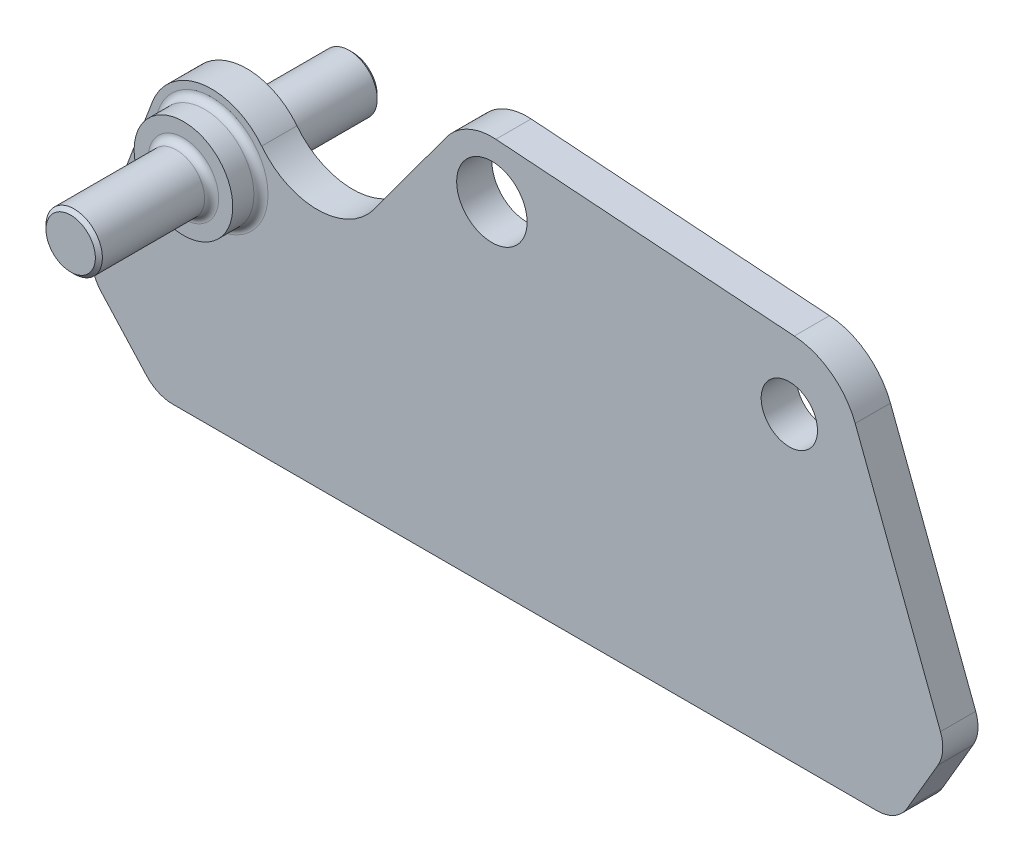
ISO-10303-21;
HEADER;
FILE_DESCRIPTION(('STEP AP214'),'2;1');
FILE_NAME('part.step','',(''),(''),'','','');
FILE_SCHEMA(('AUTOMOTIVE_DESIGN { 1 0 10303 214 1 1 1 1 }'));
ENDSEC;
DATA;
#1=APPLICATION_CONTEXT('core data for automotive mechanical design processes');
#2=APPLICATION_PROTOCOL_DEFINITION('international standard','automotive_design',2000,#1);
#3=PRODUCT_CONTEXT('',#1,'mechanical');
#4=PRODUCT('Part','Part','',(#3));
#5=PRODUCT_RELATED_PRODUCT_CATEGORY('part','',(#4));
#6=PRODUCT_DEFINITION_FORMATION('','',#4);
#7=PRODUCT_DEFINITION_CONTEXT('part definition',#1,'design');
#8=PRODUCT_DEFINITION('design','',#6,#7);
#9=PRODUCT_DEFINITION_SHAPE('','',#8);
#10=(LENGTH_UNIT() NAMED_UNIT(*) SI_UNIT(.MILLI.,.METRE.));
#11=(NAMED_UNIT(*) PLANE_ANGLE_UNIT() SI_UNIT($,.RADIAN.));
#12=(NAMED_UNIT(*) SI_UNIT($,.STERADIAN.) SOLID_ANGLE_UNIT());
#13=UNCERTAINTY_MEASURE_WITH_UNIT(LENGTH_MEASURE(1.E-05),#10,'distance_accuracy_value','');
#14=(GEOMETRIC_REPRESENTATION_CONTEXT(3) GLOBAL_UNCERTAINTY_ASSIGNED_CONTEXT((#13)) GLOBAL_UNIT_ASSIGNED_CONTEXT((#10,
#11,#12)) REPRESENTATION_CONTEXT('',''));
#15=CARTESIAN_POINT('',(0.,0.,0.));
#16=DIRECTION('',(0.,0.,1.));
#17=DIRECTION('',(1.,0.,0.));
#18=AXIS2_PLACEMENT_3D('',#15,#16,#17);
#19=CARTESIAN_POINT('',(-39.764934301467,-15.,-4.92661467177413E-13));
#20=DIRECTION('',(0.,0.,0.999999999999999));
#21=DIRECTION('',(1.00000000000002,0.,0.));
#22=AXIS2_PLACEMENT_3D('',#19,#20,#21);
#23=PLANE('',#22);
#24=CARTESIAN_POINT('',(-39.764934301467,-15.,-4.92661467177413E-13));
#25=DIRECTION('',(0.,0.,0.999999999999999));
#26=DIRECTION('',(1.00000000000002,0.,0.));
#27=AXIS2_PLACEMENT_3D('',#24,#25,#26);
#28=CIRCLE('',#27,5.00000000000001);
#29=CARTESIAN_POINT('',(-34.7649343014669,-15.,-4.92661467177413E-13));
#30=VERTEX_POINT('',#29);
#31=EDGE_CURVE('E243',#30,#30,#28,.T.);
#32=ORIENTED_EDGE('',*,*,#31,.T.);
#33=EDGE_LOOP('',(#32));
#34=FACE_BOUND('',#33,.T.);
#35=CARTESIAN_POINT('',(42.2048575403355,-5.,0.));
#36=DIRECTION('',(0.,0.,0.999999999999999));
#37=DIRECTION('',(1.00000000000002,0.,0.));
#38=AXIS2_PLACEMENT_3D('',#35,#36,#37);
#39=CIRCLE('',#38,4.00000000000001);
#40=CARTESIAN_POINT('',(38.2048575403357,-5.00000000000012,0.));
#41=VERTEX_POINT('',#40);
#42=EDGE_CURVE('E299',#41,#41,#39,.T.);
#43=ORIENTED_EDGE('',*,*,#42,.T.);
#44=EDGE_LOOP('',(#43));
#45=FACE_BOUND('',#44,.T.);
#46=DIRECTION('',(1.00000000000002,0.,0.));
#47=VECTOR('',#46,1.);
#48=CARTESIAN_POINT('',(-47.5,-47.5,0.));
#49=LINE('',#48,#47);
#50=CARTESIAN_POINT('',(-45.2881505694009,-47.4999999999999,4.44089209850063E-13));
#51=VERTEX_POINT('',#50);
#52=CARTESIAN_POINT('',(54.6281483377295,-47.5,0.));
#53=VERTEX_POINT('',#52);
#54=EDGE_CURVE('E284',#51,#53,#49,.T.);
#55=ORIENTED_EDGE('',*,*,#54,.F.);
#56=CARTESIAN_POINT('',(-45.2881505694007,-42.5,0.));
#57=DIRECTION('',(0.,0.,0.999999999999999));
#58=DIRECTION('',(1.00000000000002,0.,0.));
#59=AXIS2_PLACEMENT_3D('',#56,#57,#58);
#60=CIRCLE('',#59,5.);
#61=CARTESIAN_POINT('',(-48.9878509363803,-45.8633639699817,0.));
#62=VERTEX_POINT('',#61);
#63=EDGE_CURVE('E257',#51,#62,#60,.F.);
#64=ORIENTED_EDGE('',*,*,#63,.T.);
#65=DIRECTION('',(0.672672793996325,-0.739940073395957,0.));
#66=VECTOR('',#65,1.);
#67=CARTESIAN_POINT('',(-47.5,-47.5,0.));
#68=LINE('',#67,#66);
#69=CARTESIAN_POINT('',(-55.4408269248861,-38.7650903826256,0.));
#70=VERTEX_POINT('',#69);
#71=EDGE_CURVE('E285',#70,#62,#68,.T.);
#72=ORIENTED_EDGE('',*,*,#71,.F.);
#73=CARTESIAN_POINT('',(-51.7411265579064,-35.4017264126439,0.));
#74=DIRECTION('',(0.,0.,0.999999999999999));
#75=DIRECTION('',(1.00000000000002,0.,0.));
#76=AXIS2_PLACEMENT_3D('',#73,#74,#75);
#77=CIRCLE('',#76,5.);
#78=CARTESIAN_POINT('',(-56.4189860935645,-33.6360451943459,0.));
#79=VERTEX_POINT('',#78);
#80=EDGE_CURVE('E255',#70,#79,#77,.F.);
#81=ORIENTED_EDGE('',*,*,#80,.T.);
#82=DIRECTION('',(-0.35313624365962,-0.935571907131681,0.));
#83=VECTOR('',#82,1.);
#84=CARTESIAN_POINT('',(-57.4999999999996,-36.5,0.));
#85=LINE('',#84,#83);
#86=CARTESIAN_POINT('',(-48.1850814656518,-11.8217738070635,0.));
#87=VERTEX_POINT('',#86);
#88=EDGE_CURVE('E176',#87,#79,#85,.T.);
#89=ORIENTED_EDGE('',*,*,#88,.F.);
#90=CARTESIAN_POINT('',(-39.764934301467,-15.,-4.92661467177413E-13));
#91=DIRECTION('',(0.,0.,0.999999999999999));
#92=DIRECTION('',(1.00000000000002,0.,0.));
#93=AXIS2_PLACEMENT_3D('',#90,#91,#92);
#94=CIRCLE('',#93,9.);
#95=CARTESIAN_POINT('',(-32.6596711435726,-9.47594031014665,0.));
#96=VERTEX_POINT('',#95);
#97=EDGE_CURVE('E174',#96,#87,#94,.T.);
#98=ORIENTED_EDGE('',*,*,#97,.F.);
#99=CARTESIAN_POINT('',(-24.7649343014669,-3.33809621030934,0.));
#100=DIRECTION('',(0.,0.,-0.999999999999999));
#101=DIRECTION('',(1.00000000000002,0.,0.));
#102=AXIS2_PLACEMENT_3D('',#99,#100,#101);
#103=CIRCLE('',#102,10.);
#104=CARTESIAN_POINT('',(-16.6997034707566,-9.25012222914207,0.));
#105=VERTEX_POINT('',#104);
#106=EDGE_CURVE('E172',#105,#96,#103,.T.);
#107=ORIENTED_EDGE('',*,*,#106,.F.);
#108=DIRECTION('',(-0.591202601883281,-0.806523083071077,0.));
#109=VECTOR('',#108,1.);
#110=CARTESIAN_POINT('',(-6.45218466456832,4.72962081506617,0.));
#111=LINE('',#110,#109);
#112=CARTESIAN_POINT('',(-6.45218466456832,4.72962081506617,0.));
#113=VERTEX_POINT('',#112);
#114=EDGE_CURVE('E170',#113,#105,#111,.T.);
#115=ORIENTED_EDGE('',*,*,#114,.F.);
#116=CARTESIAN_POINT('',(-1.11022302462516E-13,1.11022302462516E-13,0.));
#117=DIRECTION('',(0.,0.,0.999999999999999));
#118=DIRECTION('',(1.00000000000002,0.,0.));
#119=AXIS2_PLACEMENT_3D('',#116,#117,#118);
#120=CIRCLE('',#119,8.);
#121=CARTESIAN_POINT('',(0.566277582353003,7.97993293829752,0.));
#122=VERTEX_POINT('',#121);
#123=EDGE_CURVE('E165',#122,#113,#120,.T.);
#124=ORIENTED_EDGE('',*,*,#123,.F.);
#125=DIRECTION('',(-0.997491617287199,0.0707846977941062,0.));
#126=VECTOR('',#125,1.);
#127=CARTESIAN_POINT('',(0.566277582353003,7.97993293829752,0.));
#128=LINE('',#127,#126);
#129=CARTESIAN_POINT('',(42.9127045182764,4.97491617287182,4.92661467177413E-13));
#130=VERTEX_POINT('',#129);
#131=EDGE_CURVE('E163',#130,#122,#128,.T.);
#132=ORIENTED_EDGE('',*,*,#131,.F.);
#133=CARTESIAN_POINT('',(42.2048575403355,-5.,0.));
#134=DIRECTION('',(0.,0.,0.999999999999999));
#135=DIRECTION('',(1.00000000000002,0.,0.));
#136=AXIS2_PLACEMENT_3D('',#133,#134,#135);
#137=CIRCLE('',#136,10.);
#138=CARTESIAN_POINT('',(51.5520114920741,-1.44602855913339,0.));
#139=VERTEX_POINT('',#138);
#140=EDGE_CURVE('E148',#139,#130,#137,.T.);
#141=ORIENTED_EDGE('',*,*,#140,.F.);
#142=DIRECTION('',(-0.355397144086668,0.934715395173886,0.));
#143=VECTOR('',#142,1.);
#144=CARTESIAN_POINT('',(64.5,-35.5000000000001,0.));
#145=LINE('',#144,#143);
#146=CARTESIAN_POINT('',(63.6510080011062,-33.267101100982,-4.92661467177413E-13));
#147=VERTEX_POINT('',#146);
#148=EDGE_CURVE('E140',#147,#139,#145,.T.);
#149=ORIENTED_EDGE('',*,*,#148,.F.);
#150=CARTESIAN_POINT('',(58.9774310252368,-35.0440868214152,0.));
#151=DIRECTION('',(0.,0.,0.999999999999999));
#152=DIRECTION('',(1.00000000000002,0.,0.));
#153=AXIS2_PLACEMENT_3D('',#150,#151,#152);
#154=CIRCLE('',#153,5.);
#155=CARTESIAN_POINT('',(63.296325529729,-37.5634419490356,-4.92661467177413E-13));
#156=VERTEX_POINT('',#155);
#157=EDGE_CURVE('E251',#147,#156,#154,.F.);
#158=ORIENTED_EDGE('',*,*,#157,.T.);
#159=DIRECTION('',(0.503871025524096,0.863778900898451,0.));
#160=VECTOR('',#159,1.);
#161=CARTESIAN_POINT('',(57.4999999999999,-47.5,0.));
#162=LINE('',#161,#160);
#163=CARTESIAN_POINT('',(58.9470428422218,-45.0193551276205,0.));
#164=VERTEX_POINT('',#163);
#165=EDGE_CURVE('E149',#164,#156,#162,.T.);
#166=ORIENTED_EDGE('',*,*,#165,.F.);
#167=CARTESIAN_POINT('',(54.6281483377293,-42.5,0.));
#168=DIRECTION('',(0.,0.,0.999999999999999));
#169=DIRECTION('',(1.00000000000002,0.,0.));
#170=AXIS2_PLACEMENT_3D('',#167,#168,#169);
#171=CIRCLE('',#170,5.);
#172=EDGE_CURVE('E253',#164,#53,#171,.F.);
#173=ORIENTED_EDGE('',*,*,#172,.T.);
#174=EDGE_LOOP('',(#55,#64,#72,#81,#89,#98,#107,#115,#124,#132,#141,#149,#158,#166,#173));
#175=FACE_BOUND('',#174,.T.);
#176=CARTESIAN_POINT('',(-1.11022302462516E-13,1.11022302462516E-13,0.));
#177=DIRECTION('',(0.,0.,0.999999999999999));
#178=DIRECTION('',(1.00000000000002,0.,0.));
#179=AXIS2_PLACEMENT_3D('',#176,#177,#178);
#180=CIRCLE('',#179,5.);
#181=CARTESIAN_POINT('',(-4.99999999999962,0.,0.));
#182=VERTEX_POINT('',#181);
#183=EDGE_CURVE('E293',#182,#182,#180,.T.);
#184=ORIENTED_EDGE('',*,*,#183,.T.);
#185=EDGE_LOOP('',(#184));
#186=FACE_BOUND('',#185,.T.);
#187=ADVANCED_FACE('F30',(#34,#45,#175,#186),#23,.F.);
#188=CARTESIAN_POINT('',(-39.7649343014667,-15.0000000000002,8.99999999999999));
#189=DIRECTION('',(0.,0.,0.999999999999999));
#190=DIRECTION('',(1.00000000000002,0.,0.));
#191=AXIS2_PLACEMENT_3D('',#188,#189,#190);
#192=PLANE('',#191);
#193=CARTESIAN_POINT('',(-39.7649343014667,-15.0000000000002,8.99999999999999));
#194=DIRECTION('',(0.,0.,0.999999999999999));
#195=DIRECTION('',(1.00000000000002,0.,0.));
#196=AXIS2_PLACEMENT_3D('',#193,#194,#195);
#197=CIRCLE('',#196,5.00000000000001);
#198=CARTESIAN_POINT('',(-34.7649343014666,-15.0000000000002,8.99999999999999));
#199=VERTEX_POINT('',#198);
#200=EDGE_CURVE('E231',#199,#199,#197,.F.);
#201=ORIENTED_EDGE('',*,*,#200,.T.);
#202=EDGE_LOOP('',(#201));
#203=FACE_BOUND('',#202,.T.);
#204=CARTESIAN_POINT('',(-39.7649343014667,-15.0000000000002,8.99999999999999));
#205=DIRECTION('',(0.,0.,0.999999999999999));
#206=DIRECTION('',(1.00000000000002,0.,0.));
#207=AXIS2_PLACEMENT_3D('',#204,#205,#206);
#208=CIRCLE('',#207,7.);
#209=CARTESIAN_POINT('',(-46.7649343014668,-15.0000000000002,8.99999999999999));
#210=VERTEX_POINT('',#209);
#211=EDGE_CURVE('E302',#210,#210,#208,.T.);
#212=ORIENTED_EDGE('',*,*,#211,.T.);
#213=EDGE_LOOP('',(#212));
#214=FACE_BOUND('',#213,.T.);
#215=ADVANCED_FACE('F306',(#203,#214),#192,.T.);
#216=CARTESIAN_POINT('',(-39.7649343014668,-15.0000000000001,4.99999999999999));
#217=DIRECTION('',(0.,0.,0.999999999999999));
#218=DIRECTION('',(1.00000000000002,0.,0.));
#219=AXIS2_PLACEMENT_3D('',#216,#217,#218);
#220=PLANE('',#219);
#221=CARTESIAN_POINT('',(-39.7649343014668,-15.0000000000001,4.99999999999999));
#222=DIRECTION('',(0.,0.,0.999999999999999));
#223=DIRECTION('',(1.00000000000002,0.,0.));
#224=AXIS2_PLACEMENT_3D('',#221,#222,#223);
#225=CIRCLE('',#224,8.);
#226=CARTESIAN_POINT('',(-31.7649343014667,-15.0000000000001,4.99999999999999));
#227=VERTEX_POINT('',#226);
#228=EDGE_CURVE('E237',#227,#227,#225,.F.);
#229=ORIENTED_EDGE('',*,*,#228,.T.);
#230=EDGE_LOOP('',(#229));
#231=FACE_BOUND('',#230,.T.);
#232=CARTESIAN_POINT('',(42.2048575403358,-5.00000000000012,5.));
#233=DIRECTION('',(0.,0.,0.999999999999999));
#234=DIRECTION('',(1.00000000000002,0.,0.));
#235=AXIS2_PLACEMENT_3D('',#232,#233,#234);
#236=CIRCLE('',#235,4.00000000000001);
#237=CARTESIAN_POINT('',(38.2048575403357,-5.00000000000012,5.));
#238=VERTEX_POINT('',#237);
#239=EDGE_CURVE('E296',#238,#238,#236,.T.);
#240=ORIENTED_EDGE('',*,*,#239,.F.);
#241=EDGE_LOOP('',(#240));
#242=FACE_BOUND('',#241,.T.);
#243=DIRECTION('',(0.672672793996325,-0.739940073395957,0.));
#244=VECTOR('',#243,1.);
#245=CARTESIAN_POINT('',(-47.4999999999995,-47.5000000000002,4.99999999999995));
#246=LINE('',#245,#244);
#247=CARTESIAN_POINT('',(-55.4408269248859,-38.7650903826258,5.));
#248=VERTEX_POINT('',#247);
#249=CARTESIAN_POINT('',(-48.9878509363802,-45.8633639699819,5.));
#250=VERTEX_POINT('',#249);
#251=EDGE_CURVE('E178',#248,#250,#246,.T.);
#252=ORIENTED_EDGE('',*,*,#251,.T.);
#253=CARTESIAN_POINT('',(-45.2881505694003,-42.5000000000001,5.));
#254=DIRECTION('',(0.,0.,0.999999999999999));
#255=DIRECTION('',(1.00000000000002,0.,0.));
#256=AXIS2_PLACEMENT_3D('',#253,#254,#255);
#257=CIRCLE('',#256,5.);
#258=CARTESIAN_POINT('',(-45.2881505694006,-47.5000000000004,4.99999999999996));
#259=VERTEX_POINT('',#258);
#260=EDGE_CURVE('E269',#250,#259,#257,.T.);
#261=ORIENTED_EDGE('',*,*,#260,.T.);
#262=DIRECTION('',(1.00000000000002,0.,0.));
#263=VECTOR('',#262,1.);
#264=CARTESIAN_POINT('',(-47.4999999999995,-47.5000000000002,4.99999999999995));
#265=LINE('',#264,#263);
#266=CARTESIAN_POINT('',(54.6281483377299,-47.5,5.));
#267=VERTEX_POINT('',#266);
#268=EDGE_CURVE('E181',#259,#267,#265,.T.);
#269=ORIENTED_EDGE('',*,*,#268,.T.);
#270=CARTESIAN_POINT('',(54.6281483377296,-42.5000000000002,5.));
#271=DIRECTION('',(0.,0.,0.999999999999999));
#272=DIRECTION('',(1.00000000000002,0.,0.));
#273=AXIS2_PLACEMENT_3D('',#270,#271,#272);
#274=CIRCLE('',#273,5.);
#275=CARTESIAN_POINT('',(58.9470428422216,-45.0193551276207,4.99999999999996));
#276=VERTEX_POINT('',#275);
#277=EDGE_CURVE('E265',#267,#276,#274,.T.);
#278=ORIENTED_EDGE('',*,*,#277,.T.);
#279=DIRECTION('',(0.503871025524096,0.863778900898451,0.));
#280=VECTOR('',#279,1.);
#281=CARTESIAN_POINT('',(57.5,-47.5000000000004,5.));
#282=LINE('',#281,#280);
#283=CARTESIAN_POINT('',(63.2963255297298,-37.5634419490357,4.99999999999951));
#284=VERTEX_POINT('',#283);
#285=EDGE_CURVE('E184',#276,#284,#282,.T.);
#286=ORIENTED_EDGE('',*,*,#285,.T.);
#287=CARTESIAN_POINT('',(58.9774310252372,-35.0440868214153,4.99999999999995));
#288=DIRECTION('',(0.,0.,0.999999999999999));
#289=DIRECTION('',(1.00000000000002,0.,0.));
#290=AXIS2_PLACEMENT_3D('',#287,#288,#289);
#291=CIRCLE('',#290,5.);
#292=CARTESIAN_POINT('',(63.6510080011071,-33.2671011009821,4.99999999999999));
#293=VERTEX_POINT('',#292);
#294=EDGE_CURVE('E53',#284,#293,#291,.T.);
#295=ORIENTED_EDGE('',*,*,#294,.T.);
#296=DIRECTION('',(-0.355397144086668,0.934715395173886,0.));
#297=VECTOR('',#296,1.);
#298=CARTESIAN_POINT('',(64.5000000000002,-35.5000000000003,4.99999999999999));
#299=LINE('',#298,#297);
#300=CARTESIAN_POINT('',(51.5520114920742,-1.44602855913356,5.));
#301=VERTEX_POINT('',#300);
#302=EDGE_CURVE('E186',#293,#301,#299,.T.);
#303=ORIENTED_EDGE('',*,*,#302,.T.);
#304=CARTESIAN_POINT('',(42.2048575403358,-5.00000000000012,5.));
#305=DIRECTION('',(0.,0.,0.999999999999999));
#306=DIRECTION('',(1.00000000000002,0.,0.));
#307=AXIS2_PLACEMENT_3D('',#304,#305,#306);
#308=CIRCLE('',#307,10.);
#309=CARTESIAN_POINT('',(42.9127045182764,4.97491617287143,5.0000000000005));
#310=VERTEX_POINT('',#309);
#311=EDGE_CURVE('E155',#301,#310,#308,.T.);
#312=ORIENTED_EDGE('',*,*,#311,.T.);
#313=DIRECTION('',(-0.997491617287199,0.0707846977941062,0.));
#314=VECTOR('',#313,1.);
#315=CARTESIAN_POINT('',(0.566277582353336,7.97993293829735,5.));
#316=LINE('',#315,#314);
#317=CARTESIAN_POINT('',(0.566277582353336,7.97993293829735,5.));
#318=VERTEX_POINT('',#317);
#319=EDGE_CURVE('E189',#310,#318,#316,.T.);
#320=ORIENTED_EDGE('',*,*,#319,.T.);
#321=CARTESIAN_POINT('',(4.71844785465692E-13,0.,5.));
#322=DIRECTION('',(0.,0.,0.999999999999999));
#323=DIRECTION('',(1.00000000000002,0.,0.));
#324=AXIS2_PLACEMENT_3D('',#321,#322,#323);
#325=CIRCLE('',#324,8.);
#326=CARTESIAN_POINT('',(-6.45218466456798,4.72962081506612,5.00000000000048));
#327=VERTEX_POINT('',#326);
#328=EDGE_CURVE('E191',#318,#327,#325,.T.);
#329=ORIENTED_EDGE('',*,*,#328,.T.);
#330=DIRECTION('',(-0.591202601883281,-0.806523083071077,0.));
#331=VECTOR('',#330,1.);
#332=CARTESIAN_POINT('',(-6.45218466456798,4.72962081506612,5.00000000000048));
#333=LINE('',#332,#331);
#334=CARTESIAN_POINT('',(-16.6997034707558,-9.25012222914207,5.));
#335=VERTEX_POINT('',#334);
#336=EDGE_CURVE('E193',#327,#335,#333,.T.);
#337=ORIENTED_EDGE('',*,*,#336,.T.);
#338=CARTESIAN_POINT('',(-24.7649343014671,-3.33809621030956,5.00000000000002));
#339=DIRECTION('',(0.,0.,-0.999999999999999));
#340=DIRECTION('',(1.00000000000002,0.,0.));
#341=AXIS2_PLACEMENT_3D('',#338,#339,#340);
#342=CIRCLE('',#341,10.);
#343=CARTESIAN_POINT('',(-32.659671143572,-9.47594031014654,5.00000000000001));
#344=VERTEX_POINT('',#343);
#345=EDGE_CURVE('E195',#335,#344,#342,.T.);
#346=ORIENTED_EDGE('',*,*,#345,.T.);
#347=CARTESIAN_POINT('',(-39.7649343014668,-15.0000000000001,4.99999999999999));
#348=DIRECTION('',(0.,0.,0.999999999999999));
#349=DIRECTION('',(1.00000000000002,0.,0.));
#350=AXIS2_PLACEMENT_3D('',#347,#348,#349);
#351=CIRCLE('',#350,9.);
#352=CARTESIAN_POINT('',(-48.1850814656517,-11.8217738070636,5.));
#353=VERTEX_POINT('',#352);
#354=EDGE_CURVE('E197',#344,#353,#351,.T.);
#355=ORIENTED_EDGE('',*,*,#354,.T.);
#356=DIRECTION('',(-0.35313624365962,-0.935571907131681,0.));
#357=VECTOR('',#356,1.);
#358=CARTESIAN_POINT('',(-57.4999999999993,-36.5000000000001,4.99999999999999));
#359=LINE('',#358,#357);
#360=CARTESIAN_POINT('',(-56.4189860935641,-33.6360451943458,5.));
#361=VERTEX_POINT('',#360);
#362=EDGE_CURVE('E199',#353,#361,#359,.T.);
#363=ORIENTED_EDGE('',*,*,#362,.T.);
#364=CARTESIAN_POINT('',(-51.741126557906,-35.4017264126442,5.));
#365=DIRECTION('',(0.,0.,0.999999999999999));
#366=DIRECTION('',(1.00000000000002,0.,0.));
#367=AXIS2_PLACEMENT_3D('',#364,#365,#366);
#368=CIRCLE('',#367,5.);
#369=EDGE_CURVE('E267',#361,#248,#368,.T.);
#370=ORIENTED_EDGE('',*,*,#369,.T.);
#371=EDGE_LOOP('',(#252,#261,#269,#278,#286,#295,#303,#312,#320,#329,#337,#346,#355,#363,#370));
#372=FACE_BOUND('',#371,.T.);
#373=CARTESIAN_POINT('',(4.71844785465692E-13,0.,5.));
#374=DIRECTION('',(0.,0.,0.999999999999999));
#375=DIRECTION('',(1.00000000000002,0.,0.));
#376=AXIS2_PLACEMENT_3D('',#373,#374,#375);
#377=CIRCLE('',#376,5.);
#378=CARTESIAN_POINT('',(-4.99999999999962,0.,5.));
#379=VERTEX_POINT('',#378);
#380=EDGE_CURVE('E290',#379,#379,#377,.T.);
#381=ORIENTED_EDGE('',*,*,#380,.F.);
#382=EDGE_LOOP('',(#381));
#383=FACE_BOUND('',#382,.T.);
#384=ADVANCED_FACE('F331',(#231,#242,#372,#383),#220,.T.);
#385=CARTESIAN_POINT('',(-47.4999999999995,-47.5000000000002,4.99999999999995));
#386=DIRECTION('',(0.739940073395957,0.672672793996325,0.));
#387=DIRECTION('',(-0.672672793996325,0.739940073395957,0.));
#388=AXIS2_PLACEMENT_3D('',#385,#386,#387);
#389=PLANE('',#388);
#390=ORIENTED_EDGE('',*,*,#71,.T.);
#391=DIRECTION('',(0.,0.,-0.999999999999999));
#392=VECTOR('',#391,1.);
#393=CARTESIAN_POINT('',(-48.9878509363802,-45.8633639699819,5.));
#394=LINE('',#393,#392);
#395=EDGE_CURVE('E262',#62,#250,#394,.F.);
#396=ORIENTED_EDGE('',*,*,#395,.T.);
#397=ORIENTED_EDGE('',*,*,#251,.F.);
#398=DIRECTION('',(0.,0.,-0.999999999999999));
#399=VECTOR('',#398,1.);
#400=CARTESIAN_POINT('',(-55.4408269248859,-38.7650903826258,5.));
#401=LINE('',#400,#399);
#402=EDGE_CURVE('E259',#248,#70,#401,.T.);
#403=ORIENTED_EDGE('',*,*,#402,.T.);
#404=EDGE_LOOP('',(#390,#396,#397,#403));
#405=FACE_BOUND('',#404,.T.);
#406=ADVANCED_FACE('F32',(#405),#389,.F.);
#407=CARTESIAN_POINT('',(-47.4999999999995,-47.5000000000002,4.99999999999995));
#408=DIRECTION('',(0.,1.00000000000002,0.));
#409=DIRECTION('',(0.,0.,0.999999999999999));
#410=AXIS2_PLACEMENT_3D('',#407,#408,#409);
#411=PLANE('',#410);
#412=ORIENTED_EDGE('',*,*,#268,.F.);
#413=DIRECTION('',(0.,0.,-0.999999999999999));
#414=VECTOR('',#413,1.);
#415=CARTESIAN_POINT('',(-45.2881505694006,-47.5000000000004,4.99999999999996));
#416=LINE('',#415,#414);
#417=EDGE_CURVE('E248',#259,#51,#416,.T.);
#418=ORIENTED_EDGE('',*,*,#417,.T.);
#419=ORIENTED_EDGE('',*,*,#54,.T.);
#420=DIRECTION('',(0.,0.,-0.999999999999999));
#421=VECTOR('',#420,1.);
#422=CARTESIAN_POINT('',(54.6281483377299,-47.5,5.));
#423=LINE('',#422,#421);
#424=EDGE_CURVE('E246',#53,#267,#423,.F.);
#425=ORIENTED_EDGE('',*,*,#424,.T.);
#426=EDGE_LOOP('',(#412,#418,#419,#425));
#427=FACE_BOUND('',#426,.T.);
#428=ADVANCED_FACE('F367',(#427),#411,.F.);
#429=CARTESIAN_POINT('',(57.5,-47.5000000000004,5.));
#430=DIRECTION('',(-0.863778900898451,0.503871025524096,0.));
#431=DIRECTION('',(-0.503871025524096,-0.863778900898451,0.));
#432=AXIS2_PLACEMENT_3D('',#429,#430,#431);
#433=PLANE('',#432);
#434=ORIENTED_EDGE('',*,*,#285,.F.);
#435=DIRECTION('',(0.,0.,-0.999999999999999));
#436=VECTOR('',#435,1.);
#437=CARTESIAN_POINT('',(58.9470428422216,-45.0193551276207,4.99999999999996));
#438=LINE('',#437,#436);
#439=EDGE_CURVE('E38',#276,#164,#438,.T.);
#440=ORIENTED_EDGE('',*,*,#439,.T.);
#441=ORIENTED_EDGE('',*,*,#165,.T.);
#442=DIRECTION('',(0.,0.,-0.999999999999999));
#443=VECTOR('',#442,1.);
#444=CARTESIAN_POINT('',(63.2963255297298,-37.5634419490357,4.99999999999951));
#445=LINE('',#444,#443);
#446=EDGE_CURVE('E272',#156,#284,#445,.F.);
#447=ORIENTED_EDGE('',*,*,#446,.T.);
#448=EDGE_LOOP('',(#434,#440,#441,#447));
#449=FACE_BOUND('',#448,.T.);
#450=ADVANCED_FACE('F279',(#449),#433,.F.);
#451=CARTESIAN_POINT('',(64.5000000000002,-35.5000000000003,4.99999999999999));
#452=DIRECTION('',(-0.934715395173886,-0.355397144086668,0.));
#453=DIRECTION('',(0.355397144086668,-0.934715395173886,0.));
#454=AXIS2_PLACEMENT_3D('',#451,#452,#453);
#455=PLANE('',#454);
#456=ORIENTED_EDGE('',*,*,#302,.F.);
#457=DIRECTION('',(0.,0.,-0.999999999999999));
#458=VECTOR('',#457,1.);
#459=CARTESIAN_POINT('',(63.6510080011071,-33.2671011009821,4.99999999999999));
#460=LINE('',#459,#458);
#461=EDGE_CURVE('E11',#293,#147,#460,.T.);
#462=ORIENTED_EDGE('',*,*,#461,.T.);
#463=ORIENTED_EDGE('',*,*,#148,.T.);
#464=DIRECTION('',(0.,0.,-0.999999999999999));
#465=VECTOR('',#464,1.);
#466=CARTESIAN_POINT('',(51.5520114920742,-1.44602855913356,5.));
#467=LINE('',#466,#465);
#468=EDGE_CURVE('E143',#301,#139,#467,.T.);
#469=ORIENTED_EDGE('',*,*,#468,.F.);
#470=EDGE_LOOP('',(#456,#462,#463,#469));
#471=FACE_BOUND('',#470,.T.);
#472=ADVANCED_FACE('F142',(#471),#455,.F.);
#473=CARTESIAN_POINT('',(42.2048575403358,-5.00000000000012,5.));
#474=DIRECTION('',(0.,0.,-0.999999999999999));
#475=DIRECTION('',(-1.00000000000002,0.,0.));
#476=AXIS2_PLACEMENT_3D('',#473,#474,#475);
#477=CYLINDRICAL_SURFACE('',#476,10.);
#478=ORIENTED_EDGE('',*,*,#140,.T.);
#479=DIRECTION('',(0.,0.,-0.999999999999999));
#480=VECTOR('',#479,1.);
#481=CARTESIAN_POINT('',(42.9127045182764,4.97491617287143,5.0000000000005));
#482=LINE('',#481,#480);
#483=EDGE_CURVE('E157',#310,#130,#482,.T.);
#484=ORIENTED_EDGE('',*,*,#483,.F.);
#485=ORIENTED_EDGE('',*,*,#311,.F.);
#486=ORIENTED_EDGE('',*,*,#468,.T.);
#487=EDGE_LOOP('',(#478,#484,#485,#486));
#488=FACE_BOUND('',#487,.T.);
#489=ADVANCED_FACE('F152',(#488),#477,.T.);
#490=CARTESIAN_POINT('',(0.566277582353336,7.97993293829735,5.));
#491=DIRECTION('',(-0.0707846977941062,-0.997491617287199,0.));
#492=DIRECTION('',(0.997491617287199,-0.0707846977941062,0.));
#493=AXIS2_PLACEMENT_3D('',#490,#491,#492);
#494=PLANE('',#493);
#495=ORIENTED_EDGE('',*,*,#131,.T.);
#496=DIRECTION('',(0.,0.,-0.999999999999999));
#497=VECTOR('',#496,1.);
#498=CARTESIAN_POINT('',(0.566277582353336,7.97993293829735,5.));
#499=LINE('',#498,#497);
#500=EDGE_CURVE('E213',#318,#122,#499,.T.);
#501=ORIENTED_EDGE('',*,*,#500,.F.);
#502=ORIENTED_EDGE('',*,*,#319,.F.);
#503=ORIENTED_EDGE('',*,*,#483,.T.);
#504=EDGE_LOOP('',(#495,#501,#502,#503));
#505=FACE_BOUND('',#504,.T.);
#506=ADVANCED_FACE('F357',(#505),#494,.F.);
#507=CARTESIAN_POINT('',(4.71844785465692E-13,0.,5.));
#508=DIRECTION('',(0.,0.,-0.999999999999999));
#509=DIRECTION('',(-1.00000000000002,0.,0.));
#510=AXIS2_PLACEMENT_3D('',#507,#508,#509);
#511=CYLINDRICAL_SURFACE('',#510,8.);
#512=ORIENTED_EDGE('',*,*,#123,.T.);
#513=DIRECTION('',(0.,0.,-0.999999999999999));
#514=VECTOR('',#513,1.);
#515=CARTESIAN_POINT('',(-6.45218466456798,4.72962081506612,5.00000000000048));
#516=LINE('',#515,#514);
#517=EDGE_CURVE('E210',#327,#113,#516,.T.);
#518=ORIENTED_EDGE('',*,*,#517,.F.);
#519=ORIENTED_EDGE('',*,*,#328,.F.);
#520=ORIENTED_EDGE('',*,*,#500,.T.);
#521=EDGE_LOOP('',(#512,#518,#519,#520));
#522=FACE_BOUND('',#521,.T.);
#523=ADVANCED_FACE('F353',(#522),#511,.T.);
#524=CARTESIAN_POINT('',(-6.45218466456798,4.72962081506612,5.00000000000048));
#525=DIRECTION('',(0.806523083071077,-0.591202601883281,0.));
#526=DIRECTION('',(0.591202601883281,0.806523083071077,0.));
#527=AXIS2_PLACEMENT_3D('',#524,#525,#526);
#528=PLANE('',#527);
#529=ORIENTED_EDGE('',*,*,#114,.T.);
#530=DIRECTION('',(0.,0.,-0.999999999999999));
#531=VECTOR('',#530,1.);
#532=CARTESIAN_POINT('',(-16.6997034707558,-9.25012222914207,5.));
#533=LINE('',#532,#531);
#534=EDGE_CURVE('E207',#335,#105,#533,.T.);
#535=ORIENTED_EDGE('',*,*,#534,.F.);
#536=ORIENTED_EDGE('',*,*,#336,.F.);
#537=ORIENTED_EDGE('',*,*,#517,.T.);
#538=EDGE_LOOP('',(#529,#535,#536,#537));
#539=FACE_BOUND('',#538,.T.);
#540=ADVANCED_FACE('F349',(#539),#528,.F.);
#541=CARTESIAN_POINT('',(-24.7649343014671,-3.33809621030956,5.00000000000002));
#542=DIRECTION('',(0.,0.,-0.999999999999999));
#543=DIRECTION('',(-1.00000000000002,0.,0.));
#544=AXIS2_PLACEMENT_3D('',#541,#542,#543);
#545=CYLINDRICAL_SURFACE('',#544,10.);
#546=ORIENTED_EDGE('',*,*,#106,.T.);
#547=DIRECTION('',(0.,0.,-0.999999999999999));
#548=VECTOR('',#547,1.);
#549=CARTESIAN_POINT('',(-32.659671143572,-9.47594031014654,5.00000000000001));
#550=LINE('',#549,#548);
#551=EDGE_CURVE('E204',#344,#96,#550,.T.);
#552=ORIENTED_EDGE('',*,*,#551,.F.);
#553=ORIENTED_EDGE('',*,*,#345,.F.);
#554=ORIENTED_EDGE('',*,*,#534,.T.);
#555=EDGE_LOOP('',(#546,#552,#553,#554));
#556=FACE_BOUND('',#555,.T.);
#557=ADVANCED_FACE('F345',(#556),#545,.F.);
#558=CARTESIAN_POINT('',(-39.7649343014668,-15.0000000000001,4.99999999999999));
#559=DIRECTION('',(0.,0.,-0.999999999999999));
#560=DIRECTION('',(-1.00000000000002,0.,0.));
#561=AXIS2_PLACEMENT_3D('',#558,#559,#560);
#562=CYLINDRICAL_SURFACE('',#561,9.);
#563=ORIENTED_EDGE('',*,*,#97,.T.);
#564=DIRECTION('',(0.,0.,-0.999999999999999));
#565=VECTOR('',#564,1.);
#566=CARTESIAN_POINT('',(-48.1850814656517,-11.8217738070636,5.));
#567=LINE('',#566,#565);
#568=EDGE_CURVE('E201',#353,#87,#567,.T.);
#569=ORIENTED_EDGE('',*,*,#568,.F.);
#570=ORIENTED_EDGE('',*,*,#354,.F.);
#571=ORIENTED_EDGE('',*,*,#551,.T.);
#572=EDGE_LOOP('',(#563,#569,#570,#571));
#573=FACE_BOUND('',#572,.T.);
#574=ADVANCED_FACE('F342',(#573),#562,.T.);
#575=CARTESIAN_POINT('',(-57.4999999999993,-36.5000000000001,4.99999999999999));
#576=DIRECTION('',(0.935571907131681,-0.35313624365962,0.));
#577=DIRECTION('',(0.35313624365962,0.935571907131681,0.));
#578=AXIS2_PLACEMENT_3D('',#575,#576,#577);
#579=PLANE('',#578);
#580=ORIENTED_EDGE('',*,*,#88,.T.);
#581=DIRECTION('',(0.,0.,-0.999999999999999));
#582=VECTOR('',#581,1.);
#583=CARTESIAN_POINT('',(-56.4189860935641,-33.6360451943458,5.));
#584=LINE('',#583,#582);
#585=EDGE_CURVE('E45',#79,#361,#584,.F.);
#586=ORIENTED_EDGE('',*,*,#585,.T.);
#587=ORIENTED_EDGE('',*,*,#362,.F.);
#588=ORIENTED_EDGE('',*,*,#568,.T.);
#589=EDGE_LOOP('',(#580,#586,#587,#588));
#590=FACE_BOUND('',#589,.T.);
#591=ADVANCED_FACE('F339',(#590),#579,.F.);
#592=CARTESIAN_POINT('',(4.71844785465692E-13,0.,5.));
#593=DIRECTION('',(0.,0.,-0.999999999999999));
#594=DIRECTION('',(-1.00000000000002,0.,0.));
#595=AXIS2_PLACEMENT_3D('',#592,#593,#594);
#596=CYLINDRICAL_SURFACE('',#595,5.);
#597=CARTESIAN_POINT('',(-4.99999999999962,0.,5.));
#598=CARTESIAN_POINT('',(-4.99999999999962,0.,4.94791666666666));
#599=CARTESIAN_POINT('',(-4.99999999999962,0.,4.89583333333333));
#600=CARTESIAN_POINT('',(-4.99999999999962,0.,4.79166666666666));
#601=CARTESIAN_POINT('',(-4.99999999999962,0.,4.73958333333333));
#602=CARTESIAN_POINT('',(-4.99999999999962,0.,4.63541666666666));
#603=CARTESIAN_POINT('',(-4.99999999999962,0.,4.58333333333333));
#604=CARTESIAN_POINT('',(-4.99999999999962,0.,4.47916666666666));
#605=CARTESIAN_POINT('',(-4.99999999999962,0.,4.42708333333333));
#606=CARTESIAN_POINT('',(-4.99999999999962,0.,4.32291666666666));
#607=CARTESIAN_POINT('',(-4.99999999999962,0.,4.27083333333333));
#608=CARTESIAN_POINT('',(-4.99999999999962,0.,4.16666666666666));
#609=CARTESIAN_POINT('',(-4.99999999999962,0.,4.11458333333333));
#610=CARTESIAN_POINT('',(-4.99999999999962,0.,4.01041666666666));
#611=CARTESIAN_POINT('',(-4.99999999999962,0.,3.95833333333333));
#612=CARTESIAN_POINT('',(-4.99999999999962,0.,3.85416666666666));
#613=CARTESIAN_POINT('',(-4.99999999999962,0.,3.80208333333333));
#614=CARTESIAN_POINT('',(-4.99999999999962,0.,3.69791666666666));
#615=CARTESIAN_POINT('',(-4.99999999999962,0.,3.64583333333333));
#616=CARTESIAN_POINT('',(-4.99999999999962,0.,3.54166666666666));
#617=CARTESIAN_POINT('',(-4.99999999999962,0.,3.48958333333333));
#618=CARTESIAN_POINT('',(-4.99999999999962,0.,3.38541666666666));
#619=CARTESIAN_POINT('',(-4.99999999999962,0.,3.33333333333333));
#620=CARTESIAN_POINT('',(-4.99999999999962,0.,3.22916666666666));
#621=CARTESIAN_POINT('',(-4.99999999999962,0.,3.17708333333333));
#622=CARTESIAN_POINT('',(-4.99999999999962,0.,3.07291666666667));
#623=CARTESIAN_POINT('',(-4.99999999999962,0.,3.02083333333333));
#624=CARTESIAN_POINT('',(-4.99999999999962,0.,2.91666666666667));
#625=CARTESIAN_POINT('',(-4.99999999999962,0.,2.86458333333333));
#626=CARTESIAN_POINT('',(-4.99999999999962,0.,2.76041666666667));
#627=CARTESIAN_POINT('',(-4.99999999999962,0.,2.70833333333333));
#628=CARTESIAN_POINT('',(-4.99999999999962,0.,2.60416666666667));
#629=CARTESIAN_POINT('',(-4.99999999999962,0.,2.55208333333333));
#630=CARTESIAN_POINT('',(-4.99999999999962,0.,2.44791666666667));
#631=CARTESIAN_POINT('',(-4.99999999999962,0.,2.39583333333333));
#632=CARTESIAN_POINT('',(-4.99999999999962,0.,2.29166666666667));
#633=CARTESIAN_POINT('',(-4.99999999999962,0.,2.23958333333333));
#634=CARTESIAN_POINT('',(-4.99999999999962,0.,2.13541666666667));
#635=CARTESIAN_POINT('',(-4.99999999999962,0.,2.08333333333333));
#636=CARTESIAN_POINT('',(-4.99999999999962,0.,1.97916666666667));
#637=CARTESIAN_POINT('',(-4.99999999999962,0.,1.92708333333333));
#638=CARTESIAN_POINT('',(-4.99999999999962,0.,1.82291666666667));
#639=CARTESIAN_POINT('',(-4.99999999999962,0.,1.77083333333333));
#640=CARTESIAN_POINT('',(-4.99999999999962,0.,1.66666666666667));
#641=CARTESIAN_POINT('',(-4.99999999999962,0.,1.61458333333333));
#642=CARTESIAN_POINT('',(-4.99999999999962,0.,1.51041666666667));
#643=CARTESIAN_POINT('',(-4.99999999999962,0.,1.45833333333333));
#644=CARTESIAN_POINT('',(-4.99999999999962,0.,1.35416666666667));
#645=CARTESIAN_POINT('',(-4.99999999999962,0.,1.30208333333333));
#646=CARTESIAN_POINT('',(-4.99999999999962,0.,1.19791666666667));
#647=CARTESIAN_POINT('',(-4.99999999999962,0.,1.14583333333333));
#648=CARTESIAN_POINT('',(-4.99999999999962,0.,1.04166666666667));
#649=CARTESIAN_POINT('',(-4.99999999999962,0.,0.989583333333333));
#650=CARTESIAN_POINT('',(-4.99999999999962,0.,0.885416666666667));
#651=CARTESIAN_POINT('',(-4.99999999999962,0.,0.833333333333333));
#652=CARTESIAN_POINT('',(-4.99999999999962,0.,0.729166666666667));
#653=CARTESIAN_POINT('',(-4.99999999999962,0.,0.677083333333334));
#654=CARTESIAN_POINT('',(-4.99999999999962,0.,0.572916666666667));
#655=CARTESIAN_POINT('',(-4.99999999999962,0.,0.520833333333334));
#656=CARTESIAN_POINT('',(-4.99999999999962,0.,0.416666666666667));
#657=CARTESIAN_POINT('',(-4.99999999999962,0.,0.364583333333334));
#658=CARTESIAN_POINT('',(-4.99999999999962,0.,0.260416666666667));
#659=CARTESIAN_POINT('',(-4.99999999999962,0.,0.208333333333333));
#660=CARTESIAN_POINT('',(-4.99999999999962,0.,0.104166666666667));
#661=CARTESIAN_POINT('',(-4.99999999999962,0.,0.0520833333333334));
#662=CARTESIAN_POINT('',(-4.99999999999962,0.,0.));
#663=B_SPLINE_CURVE_WITH_KNOTS('',3,(#597,#598,#599,#600,#601,#602,#603,#604,#605,#606,#607,
#608,#609,#610,#611,#612,#613,#614,#615,#616,#617,#618,#619,#620,#621,#622,#623,#624,#625,#626,
#627,#628,#629,#630,#631,#632,#633,#634,#635,#636,#637,#638,#639,#640,#641,#642,#643,#644,#645,
#646,#647,#648,#649,#650,#651,#652,#653,#654,#655,#656,#657,#658,#659,#660,#661,#662),
.UNSPECIFIED.,.F.,.F.,(4,2,2,2,2,2,2,2,2,2,2,2,2,2,2,2,2,2,2,2,2,2,2,2,2,2,2,2,2,2,2,2,4),(0.,
0.15625,0.3125,0.46875,0.625000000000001,0.78125,0.9375,1.09375,1.25,1.40625,1.5625,1.71875,
1.875,2.03125,2.1875,2.34375,2.5,2.65625,2.8125,2.96875,3.125,3.28125,3.4375,3.59375,3.75,
3.90625,4.0625,4.21875,4.375,4.53125,4.6875,4.84375,5.),.UNSPECIFIED.);
#664=EDGE_CURVE('BSEAM321',#379,#182,#663,.T.);
#665=ORIENTED_EDGE('',*,*,#380,.T.);
#666=ORIENTED_EDGE('',*,*,#183,.F.);
#667=ORIENTED_EDGE('',*,*,#664,.T.);
#668=ORIENTED_EDGE('',*,*,#664,.F.);
#669=EDGE_LOOP('',(#665,#667,#666,#668));
#670=FACE_BOUND('',#669,.T.);
#671=ADVANCED_FACE('F321',(#670),#596,.F.);
#672=CARTESIAN_POINT('',(42.2048575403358,-5.00000000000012,5.));
#673=DIRECTION('',(0.,0.,-0.999999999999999));
#674=DIRECTION('',(-1.00000000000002,0.,0.));
#675=AXIS2_PLACEMENT_3D('',#672,#673,#674);
#676=CYLINDRICAL_SURFACE('',#675,4.00000000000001);
#677=CARTESIAN_POINT('',(38.2048575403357,-5.00000000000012,5.));
#678=CARTESIAN_POINT('',(38.2048575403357,-5.00000000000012,4.94791666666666));
#679=CARTESIAN_POINT('',(38.2048575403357,-5.00000000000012,4.89583333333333));
#680=CARTESIAN_POINT('',(38.2048575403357,-5.00000000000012,4.79166666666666));
#681=CARTESIAN_POINT('',(38.2048575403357,-5.00000000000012,4.73958333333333));
#682=CARTESIAN_POINT('',(38.2048575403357,-5.00000000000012,4.63541666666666));
#683=CARTESIAN_POINT('',(38.2048575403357,-5.00000000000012,4.58333333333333));
#684=CARTESIAN_POINT('',(38.2048575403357,-5.00000000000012,4.47916666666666));
#685=CARTESIAN_POINT('',(38.2048575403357,-5.00000000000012,4.42708333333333));
#686=CARTESIAN_POINT('',(38.2048575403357,-5.00000000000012,4.32291666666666));
#687=CARTESIAN_POINT('',(38.2048575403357,-5.00000000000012,4.27083333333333));
#688=CARTESIAN_POINT('',(38.2048575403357,-5.00000000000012,4.16666666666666));
#689=CARTESIAN_POINT('',(38.2048575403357,-5.00000000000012,4.11458333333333));
#690=CARTESIAN_POINT('',(38.2048575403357,-5.00000000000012,4.01041666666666));
#691=CARTESIAN_POINT('',(38.2048575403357,-5.00000000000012,3.95833333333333));
#692=CARTESIAN_POINT('',(38.2048575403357,-5.00000000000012,3.85416666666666));
#693=CARTESIAN_POINT('',(38.2048575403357,-5.00000000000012,3.80208333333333));
#694=CARTESIAN_POINT('',(38.2048575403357,-5.00000000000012,3.69791666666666));
#695=CARTESIAN_POINT('',(38.2048575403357,-5.00000000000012,3.64583333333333));
#696=CARTESIAN_POINT('',(38.2048575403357,-5.00000000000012,3.54166666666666));
#697=CARTESIAN_POINT('',(38.2048575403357,-5.00000000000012,3.48958333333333));
#698=CARTESIAN_POINT('',(38.2048575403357,-5.00000000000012,3.38541666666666));
#699=CARTESIAN_POINT('',(38.2048575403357,-5.00000000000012,3.33333333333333));
#700=CARTESIAN_POINT('',(38.2048575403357,-5.00000000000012,3.22916666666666));
#701=CARTESIAN_POINT('',(38.2048575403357,-5.00000000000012,3.17708333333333));
#702=CARTESIAN_POINT('',(38.2048575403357,-5.00000000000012,3.07291666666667));
#703=CARTESIAN_POINT('',(38.2048575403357,-5.00000000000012,3.02083333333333));
#704=CARTESIAN_POINT('',(38.2048575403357,-5.00000000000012,2.91666666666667));
#705=CARTESIAN_POINT('',(38.2048575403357,-5.00000000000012,2.86458333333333));
#706=CARTESIAN_POINT('',(38.2048575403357,-5.00000000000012,2.76041666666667));
#707=CARTESIAN_POINT('',(38.2048575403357,-5.00000000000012,2.70833333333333));
#708=CARTESIAN_POINT('',(38.2048575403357,-5.00000000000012,2.60416666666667));
#709=CARTESIAN_POINT('',(38.2048575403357,-5.00000000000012,2.55208333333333));
#710=CARTESIAN_POINT('',(38.2048575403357,-5.00000000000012,2.44791666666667));
#711=CARTESIAN_POINT('',(38.2048575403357,-5.00000000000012,2.39583333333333));
#712=CARTESIAN_POINT('',(38.2048575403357,-5.00000000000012,2.29166666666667));
#713=CARTESIAN_POINT('',(38.2048575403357,-5.00000000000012,2.23958333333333));
#714=CARTESIAN_POINT('',(38.2048575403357,-5.00000000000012,2.13541666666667));
#715=CARTESIAN_POINT('',(38.2048575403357,-5.00000000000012,2.08333333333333));
#716=CARTESIAN_POINT('',(38.2048575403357,-5.00000000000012,1.97916666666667));
#717=CARTESIAN_POINT('',(38.2048575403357,-5.00000000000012,1.92708333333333));
#718=CARTESIAN_POINT('',(38.2048575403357,-5.00000000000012,1.82291666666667));
#719=CARTESIAN_POINT('',(38.2048575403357,-5.00000000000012,1.77083333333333));
#720=CARTESIAN_POINT('',(38.2048575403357,-5.00000000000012,1.66666666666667));
#721=CARTESIAN_POINT('',(38.2048575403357,-5.00000000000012,1.61458333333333));
#722=CARTESIAN_POINT('',(38.2048575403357,-5.00000000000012,1.51041666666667));
#723=CARTESIAN_POINT('',(38.2048575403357,-5.00000000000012,1.45833333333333));
#724=CARTESIAN_POINT('',(38.2048575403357,-5.00000000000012,1.35416666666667));
#725=CARTESIAN_POINT('',(38.2048575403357,-5.00000000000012,1.30208333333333));
#726=CARTESIAN_POINT('',(38.2048575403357,-5.00000000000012,1.19791666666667));
#727=CARTESIAN_POINT('',(38.2048575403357,-5.00000000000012,1.14583333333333));
#728=CARTESIAN_POINT('',(38.2048575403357,-5.00000000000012,1.04166666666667));
#729=CARTESIAN_POINT('',(38.2048575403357,-5.00000000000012,0.989583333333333));
#730=CARTESIAN_POINT('',(38.2048575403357,-5.00000000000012,0.885416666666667));
#731=CARTESIAN_POINT('',(38.2048575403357,-5.00000000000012,0.833333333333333));
#732=CARTESIAN_POINT('',(38.2048575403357,-5.00000000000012,0.729166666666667));
#733=CARTESIAN_POINT('',(38.2048575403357,-5.00000000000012,0.677083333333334));
#734=CARTESIAN_POINT('',(38.2048575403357,-5.00000000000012,0.572916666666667));
#735=CARTESIAN_POINT('',(38.2048575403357,-5.00000000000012,0.520833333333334));
#736=CARTESIAN_POINT('',(38.2048575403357,-5.00000000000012,0.416666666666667));
#737=CARTESIAN_POINT('',(38.2048575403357,-5.00000000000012,0.364583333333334));
#738=CARTESIAN_POINT('',(38.2048575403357,-5.00000000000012,0.260416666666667));
#739=CARTESIAN_POINT('',(38.2048575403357,-5.00000000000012,0.208333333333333));
#740=CARTESIAN_POINT('',(38.2048575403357,-5.00000000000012,0.104166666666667));
#741=CARTESIAN_POINT('',(38.2048575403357,-5.00000000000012,0.0520833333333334));
#742=CARTESIAN_POINT('',(38.2048575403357,-5.00000000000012,0.));
#743=B_SPLINE_CURVE_WITH_KNOTS('',3,(#677,#678,#679,#680,#681,#682,#683,#684,#685,#686,#687,
#688,#689,#690,#691,#692,#693,#694,#695,#696,#697,#698,#699,#700,#701,#702,#703,#704,#705,#706,
#707,#708,#709,#710,#711,#712,#713,#714,#715,#716,#717,#718,#719,#720,#721,#722,#723,#724,#725,
#726,#727,#728,#729,#730,#731,#732,#733,#734,#735,#736,#737,#738,#739,#740,#741,#742),
.UNSPECIFIED.,.F.,.F.,(4,2,2,2,2,2,2,2,2,2,2,2,2,2,2,2,2,2,2,2,2,2,2,2,2,2,2,2,2,2,2,2,4),(0.,
0.15625,0.3125,0.46875,0.625000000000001,0.78125,0.9375,1.09375,1.25,1.40625,1.5625,1.71875,
1.875,2.03125,2.1875,2.34375,2.5,2.65625,2.8125,2.96875,3.125,3.28125,3.4375,3.59375,3.75,
3.90625,4.0625,4.21875,4.375,4.53125,4.6875,4.84375,5.),.UNSPECIFIED.);
#744=EDGE_CURVE('BSEAM311',#238,#41,#743,.T.);
#745=ORIENTED_EDGE('',*,*,#239,.T.);
#746=ORIENTED_EDGE('',*,*,#42,.F.);
#747=ORIENTED_EDGE('',*,*,#744,.T.);
#748=ORIENTED_EDGE('',*,*,#744,.F.);
#749=EDGE_LOOP('',(#745,#747,#746,#748));
#750=FACE_BOUND('',#749,.T.);
#751=ADVANCED_FACE('F311',(#750),#676,.F.);
#752=CARTESIAN_POINT('',(-39.7649343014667,-15.0000000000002,8.99999999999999));
#753=DIRECTION('',(0.,0.,-0.999999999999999));
#754=DIRECTION('',(-1.00000000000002,0.,0.));
#755=AXIS2_PLACEMENT_3D('',#752,#753,#754);
#756=CYLINDRICAL_SURFACE('',#755,7.);
#757=CARTESIAN_POINT('',(-39.7649343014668,-15.0000000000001,5.99999999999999));
#758=DIRECTION('',(0.,0.,0.999999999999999));
#759=DIRECTION('',(1.00000000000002,0.,0.));
#760=AXIS2_PLACEMENT_3D('',#757,#758,#759);
#761=CIRCLE('',#760,7.);
#762=CARTESIAN_POINT('',(-46.7649343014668,-15.0000000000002,5.99999999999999));
#763=VERTEX_POINT('',#762);
#764=EDGE_CURVE('E234',#763,#763,#761,.T.);
#765=CARTESIAN_POINT('',(-46.7649343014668,-15.0000000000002,5.99999999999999));
#766=CARTESIAN_POINT('',(-46.7649343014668,-15.0000000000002,6.03124999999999));
#767=CARTESIAN_POINT('',(-46.7649343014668,-15.0000000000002,6.06249999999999));
#768=CARTESIAN_POINT('',(-46.7649343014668,-15.0000000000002,6.12499999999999));
#769=CARTESIAN_POINT('',(-46.7649343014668,-15.0000000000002,6.15624999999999));
#770=CARTESIAN_POINT('',(-46.7649343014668,-15.0000000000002,6.21874999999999));
#771=CARTESIAN_POINT('',(-46.7649343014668,-15.0000000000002,6.24999999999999));
#772=CARTESIAN_POINT('',(-46.7649343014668,-15.0000000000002,6.31249999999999));
#773=CARTESIAN_POINT('',(-46.7649343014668,-15.0000000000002,6.34374999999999));
#774=CARTESIAN_POINT('',(-46.7649343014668,-15.0000000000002,6.40624999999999));
#775=CARTESIAN_POINT('',(-46.7649343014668,-15.0000000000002,6.43749999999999));
#776=CARTESIAN_POINT('',(-46.7649343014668,-15.0000000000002,6.49999999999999));
#777=CARTESIAN_POINT('',(-46.7649343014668,-15.0000000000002,6.53124999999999));
#778=CARTESIAN_POINT('',(-46.7649343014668,-15.0000000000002,6.59374999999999));
#779=CARTESIAN_POINT('',(-46.7649343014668,-15.0000000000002,6.62499999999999));
#780=CARTESIAN_POINT('',(-46.7649343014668,-15.0000000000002,6.68749999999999));
#781=CARTESIAN_POINT('',(-46.7649343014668,-15.0000000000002,6.71874999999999));
#782=CARTESIAN_POINT('',(-46.7649343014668,-15.0000000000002,6.78124999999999));
#783=CARTESIAN_POINT('',(-46.7649343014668,-15.0000000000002,6.81249999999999));
#784=CARTESIAN_POINT('',(-46.7649343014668,-15.0000000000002,6.87499999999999));
#785=CARTESIAN_POINT('',(-46.7649343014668,-15.0000000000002,6.90624999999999));
#786=CARTESIAN_POINT('',(-46.7649343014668,-15.0000000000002,6.96874999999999));
#787=CARTESIAN_POINT('',(-46.7649343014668,-15.0000000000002,6.99999999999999));
#788=CARTESIAN_POINT('',(-46.7649343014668,-15.0000000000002,7.06249999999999));
#789=CARTESIAN_POINT('',(-46.7649343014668,-15.0000000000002,7.09374999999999));
#790=CARTESIAN_POINT('',(-46.7649343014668,-15.0000000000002,7.15624999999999));
#791=CARTESIAN_POINT('',(-46.7649343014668,-15.0000000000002,7.18749999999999));
#792=CARTESIAN_POINT('',(-46.7649343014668,-15.0000000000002,7.24999999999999));
#793=CARTESIAN_POINT('',(-46.7649343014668,-15.0000000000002,7.28124999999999));
#794=CARTESIAN_POINT('',(-46.7649343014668,-15.0000000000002,7.34374999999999));
#795=CARTESIAN_POINT('',(-46.7649343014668,-15.0000000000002,7.37499999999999));
#796=CARTESIAN_POINT('',(-46.7649343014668,-15.0000000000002,7.43749999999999));
#797=CARTESIAN_POINT('',(-46.7649343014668,-15.0000000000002,7.46874999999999));
#798=CARTESIAN_POINT('',(-46.7649343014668,-15.0000000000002,7.53124999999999));
#799=CARTESIAN_POINT('',(-46.7649343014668,-15.0000000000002,7.56249999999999));
#800=CARTESIAN_POINT('',(-46.7649343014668,-15.0000000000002,7.62499999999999));
#801=CARTESIAN_POINT('',(-46.7649343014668,-15.0000000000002,7.65624999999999));
#802=CARTESIAN_POINT('',(-46.7649343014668,-15.0000000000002,7.71874999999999));
#803=CARTESIAN_POINT('',(-46.7649343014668,-15.0000000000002,7.74999999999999));
#804=CARTESIAN_POINT('',(-46.7649343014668,-15.0000000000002,7.81249999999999));
#805=CARTESIAN_POINT('',(-46.7649343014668,-15.0000000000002,7.84374999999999));
#806=CARTESIAN_POINT('',(-46.7649343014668,-15.0000000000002,7.90624999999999));
#807=CARTESIAN_POINT('',(-46.7649343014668,-15.0000000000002,7.93749999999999));
#808=CARTESIAN_POINT('',(-46.7649343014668,-15.0000000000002,7.99999999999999));
#809=CARTESIAN_POINT('',(-46.7649343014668,-15.0000000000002,8.03124999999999));
#810=CARTESIAN_POINT('',(-46.7649343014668,-15.0000000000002,8.09374999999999));
#811=CARTESIAN_POINT('',(-46.7649343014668,-15.0000000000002,8.12499999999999));
#812=CARTESIAN_POINT('',(-46.7649343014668,-15.0000000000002,8.18749999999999));
#813=CARTESIAN_POINT('',(-46.7649343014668,-15.0000000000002,8.21874999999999));
#814=CARTESIAN_POINT('',(-46.7649343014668,-15.0000000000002,8.28124999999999));
#815=CARTESIAN_POINT('',(-46.7649343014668,-15.0000000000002,8.31249999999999));
#816=CARTESIAN_POINT('',(-46.7649343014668,-15.0000000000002,8.37499999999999));
#817=CARTESIAN_POINT('',(-46.7649343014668,-15.0000000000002,8.40624999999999));
#818=CARTESIAN_POINT('',(-46.7649343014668,-15.0000000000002,8.46874999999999));
#819=CARTESIAN_POINT('',(-46.7649343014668,-15.0000000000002,8.49999999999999));
#820=CARTESIAN_POINT('',(-46.7649343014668,-15.0000000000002,8.56249999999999));
#821=CARTESIAN_POINT('',(-46.7649343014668,-15.0000000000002,8.59374999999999));
#822=CARTESIAN_POINT('',(-46.7649343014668,-15.0000000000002,8.65624999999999));
#823=CARTESIAN_POINT('',(-46.7649343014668,-15.0000000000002,8.68749999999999));
#824=CARTESIAN_POINT('',(-46.7649343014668,-15.0000000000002,8.74999999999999));
#825=CARTESIAN_POINT('',(-46.7649343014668,-15.0000000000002,8.78124999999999));
#826=CARTESIAN_POINT('',(-46.7649343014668,-15.0000000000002,8.84374999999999));
#827=CARTESIAN_POINT('',(-46.7649343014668,-15.0000000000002,8.87499999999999));
#828=CARTESIAN_POINT('',(-46.7649343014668,-15.0000000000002,8.93749999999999));
#829=CARTESIAN_POINT('',(-46.7649343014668,-15.0000000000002,8.96874999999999));
#830=CARTESIAN_POINT('',(-46.7649343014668,-15.0000000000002,8.99999999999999));
#831=B_SPLINE_CURVE_WITH_KNOTS('',3,(#765,#766,#767,#768,#769,#770,#771,#772,#773,#774,#775,
#776,#777,#778,#779,#780,#781,#782,#783,#784,#785,#786,#787,#788,#789,#790,#791,#792,#793,#794,
#795,#796,#797,#798,#799,#800,#801,#802,#803,#804,#805,#806,#807,#808,#809,#810,#811,#812,#813,
#814,#815,#816,#817,#818,#819,#820,#821,#822,#823,#824,#825,#826,#827,#828,#829,#830),
.UNSPECIFIED.,.F.,.F.,(4,2,2,2,2,2,2,2,2,2,2,2,2,2,2,2,2,2,2,2,2,2,2,2,2,2,2,2,2,2,2,2,4),(0.,
0.0937500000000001,0.1875,0.28125,0.375,0.46875,0.5625,0.656250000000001,0.750000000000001,
0.843750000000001,0.937500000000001,1.03125,1.125,1.21875,1.3125,1.40625,1.5,1.59375,1.6875,
1.78125,1.875,1.96875,2.0625,2.15625,2.25,2.34375,2.4375,2.53125,2.625,2.71875,2.8125,2.90625,
3.),.UNSPECIFIED.);
#832=EDGE_CURVE('BSEAM308',#763,#210,#831,.T.);
#833=ORIENTED_EDGE('',*,*,#764,.T.);
#834=ORIENTED_EDGE('',*,*,#211,.F.);
#835=ORIENTED_EDGE('',*,*,#832,.T.);
#836=ORIENTED_EDGE('',*,*,#832,.F.);
#837=EDGE_LOOP('',(#833,#835,#834,#836));
#838=FACE_BOUND('',#837,.T.);
#839=ADVANCED_FACE('F308',(#838),#756,.T.);
#840=CARTESIAN_POINT('',(-39.7649343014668,-15.000000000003,25.));
#841=DIRECTION('',(0.,0.,-0.999999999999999));
#842=DIRECTION('',(-1.00000000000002,0.,0.));
#843=AXIS2_PLACEMENT_3D('',#840,#841,#842);
#844=CYLINDRICAL_SURFACE('',#843,4.00000000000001);
#845=CARTESIAN_POINT('',(-39.7649343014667,-15.0000000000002,9.99999999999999));
#846=DIRECTION('',(0.,0.,0.999999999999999));
#847=DIRECTION('',(1.00000000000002,0.,0.));
#848=AXIS2_PLACEMENT_3D('',#845,#846,#847);
#849=CIRCLE('',#848,4.00000000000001);
#850=CARTESIAN_POINT('',(-43.7649343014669,-15.000000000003,9.99999999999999));
#851=VERTEX_POINT('',#850);
#852=EDGE_CURVE('E228',#851,#851,#849,.T.);
#853=CARTESIAN_POINT('',(-39.7649343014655,-15.0000000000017,24.5));
#854=DIRECTION('',(0.,0.,0.999999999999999));
#855=DIRECTION('',(1.00000000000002,0.,0.));
#856=AXIS2_PLACEMENT_3D('',#853,#854,#855);
#857=CIRCLE('',#856,4.00000000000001);
#858=CARTESIAN_POINT('',(-43.7649343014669,-15.000000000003,24.5));
#859=VERTEX_POINT('',#858);
#860=EDGE_CURVE('E219',#859,#859,#857,.F.);
#861=CARTESIAN_POINT('',(-43.7649343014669,-15.000000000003,9.99999999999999));
#862=CARTESIAN_POINT('',(-43.7649343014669,-15.000000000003,10.1510416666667));
#863=CARTESIAN_POINT('',(-43.7649343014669,-15.000000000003,10.3020833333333));
#864=CARTESIAN_POINT('',(-43.7649343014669,-15.000000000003,10.6041666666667));
#865=CARTESIAN_POINT('',(-43.7649343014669,-15.000000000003,10.7552083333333));
#866=CARTESIAN_POINT('',(-43.7649343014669,-15.000000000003,11.0572916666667));
#867=CARTESIAN_POINT('',(-43.7649343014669,-15.000000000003,11.2083333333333));
#868=CARTESIAN_POINT('',(-43.7649343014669,-15.000000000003,11.5104166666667));
#869=CARTESIAN_POINT('',(-43.7649343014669,-15.000000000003,11.6614583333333));
#870=CARTESIAN_POINT('',(-43.7649343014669,-15.000000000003,11.9635416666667));
#871=CARTESIAN_POINT('',(-43.7649343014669,-15.000000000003,12.1145833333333));
#872=CARTESIAN_POINT('',(-43.7649343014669,-15.000000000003,12.4166666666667));
#873=CARTESIAN_POINT('',(-43.7649343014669,-15.000000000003,12.5677083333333));
#874=CARTESIAN_POINT('',(-43.7649343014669,-15.000000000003,12.8697916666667));
#875=CARTESIAN_POINT('',(-43.7649343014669,-15.000000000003,13.0208333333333));
#876=CARTESIAN_POINT('',(-43.7649343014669,-15.000000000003,13.3229166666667));
#877=CARTESIAN_POINT('',(-43.7649343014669,-15.000000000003,13.4739583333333));
#878=CARTESIAN_POINT('',(-43.7649343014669,-15.000000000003,13.7760416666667));
#879=CARTESIAN_POINT('',(-43.7649343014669,-15.000000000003,13.9270833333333));
#880=CARTESIAN_POINT('',(-43.7649343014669,-15.000000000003,14.2291666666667));
#881=CARTESIAN_POINT('',(-43.7649343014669,-15.000000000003,14.3802083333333));
#882=CARTESIAN_POINT('',(-43.7649343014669,-15.000000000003,14.6822916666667));
#883=CARTESIAN_POINT('',(-43.7649343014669,-15.000000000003,14.8333333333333));
#884=CARTESIAN_POINT('',(-43.7649343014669,-15.000000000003,15.1354166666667));
#885=CARTESIAN_POINT('',(-43.7649343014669,-15.000000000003,15.2864583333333));
#886=CARTESIAN_POINT('',(-43.7649343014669,-15.000000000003,15.5885416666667));
#887=CARTESIAN_POINT('',(-43.7649343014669,-15.000000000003,15.7395833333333));
#888=CARTESIAN_POINT('',(-43.7649343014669,-15.000000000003,16.0416666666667));
#889=CARTESIAN_POINT('',(-43.7649343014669,-15.000000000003,16.1927083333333));
#890=CARTESIAN_POINT('',(-43.7649343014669,-15.000000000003,16.4947916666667));
#891=CARTESIAN_POINT('',(-43.7649343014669,-15.000000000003,16.6458333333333));
#892=CARTESIAN_POINT('',(-43.7649343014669,-15.000000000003,16.9479166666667));
#893=CARTESIAN_POINT('',(-43.7649343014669,-15.000000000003,17.0989583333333));
#894=CARTESIAN_POINT('',(-43.7649343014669,-15.000000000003,17.4010416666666));
#895=CARTESIAN_POINT('',(-43.7649343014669,-15.000000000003,17.5520833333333));
#896=CARTESIAN_POINT('',(-43.7649343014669,-15.000000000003,17.8541666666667));
#897=CARTESIAN_POINT('',(-43.7649343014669,-15.000000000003,18.0052083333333));
#898=CARTESIAN_POINT('',(-43.7649343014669,-15.000000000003,18.3072916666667));
#899=CARTESIAN_POINT('',(-43.7649343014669,-15.000000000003,18.4583333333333));
#900=CARTESIAN_POINT('',(-43.7649343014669,-15.000000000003,18.7604166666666));
#901=CARTESIAN_POINT('',(-43.7649343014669,-15.000000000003,18.9114583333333));
#902=CARTESIAN_POINT('',(-43.7649343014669,-15.000000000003,19.2135416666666));
#903=CARTESIAN_POINT('',(-43.7649343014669,-15.000000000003,19.3645833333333));
#904=CARTESIAN_POINT('',(-43.7649343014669,-15.000000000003,19.6666666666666));
#905=CARTESIAN_POINT('',(-43.7649343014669,-15.000000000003,19.8177083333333));
#906=CARTESIAN_POINT('',(-43.7649343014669,-15.000000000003,20.1197916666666));
#907=CARTESIAN_POINT('',(-43.7649343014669,-15.000000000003,20.2708333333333));
#908=CARTESIAN_POINT('',(-43.7649343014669,-15.000000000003,20.5729166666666));
#909=CARTESIAN_POINT('',(-43.7649343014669,-15.000000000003,20.7239583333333));
#910=CARTESIAN_POINT('',(-43.7649343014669,-15.000000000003,21.0260416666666));
#911=CARTESIAN_POINT('',(-43.7649343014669,-15.000000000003,21.1770833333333));
#912=CARTESIAN_POINT('',(-43.7649343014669,-15.000000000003,21.4791666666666));
#913=CARTESIAN_POINT('',(-43.7649343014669,-15.000000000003,21.6302083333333));
#914=CARTESIAN_POINT('',(-43.7649343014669,-15.000000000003,21.9322916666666));
#915=CARTESIAN_POINT('',(-43.7649343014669,-15.000000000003,22.0833333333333));
#916=CARTESIAN_POINT('',(-43.7649343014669,-15.000000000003,22.3854166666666));
#917=CARTESIAN_POINT('',(-43.7649343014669,-15.000000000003,22.5364583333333));
#918=CARTESIAN_POINT('',(-43.7649343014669,-15.000000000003,22.8385416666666));
#919=CARTESIAN_POINT('',(-43.7649343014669,-15.000000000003,22.9895833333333));
#920=CARTESIAN_POINT('',(-43.7649343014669,-15.000000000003,23.2916666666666));
#921=CARTESIAN_POINT('',(-43.7649343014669,-15.000000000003,23.4427083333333));
#922=CARTESIAN_POINT('',(-43.7649343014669,-15.000000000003,23.7447916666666));
#923=CARTESIAN_POINT('',(-43.7649343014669,-15.000000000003,23.8958333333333));
#924=CARTESIAN_POINT('',(-43.7649343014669,-15.000000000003,24.1979166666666));
#925=CARTESIAN_POINT('',(-43.7649343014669,-15.000000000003,24.3489583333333));
#926=CARTESIAN_POINT('',(-43.7649343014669,-15.000000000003,24.5));
#927=B_SPLINE_CURVE_WITH_KNOTS('',3,(#861,#862,#863,#864,#865,#866,#867,#868,#869,#870,#871,
#872,#873,#874,#875,#876,#877,#878,#879,#880,#881,#882,#883,#884,#885,#886,#887,#888,#889,#890,
#891,#892,#893,#894,#895,#896,#897,#898,#899,#900,#901,#902,#903,#904,#905,#906,#907,#908,#909,
#910,#911,#912,#913,#914,#915,#916,#917,#918,#919,#920,#921,#922,#923,#924,#925,#926),
.UNSPECIFIED.,.F.,.F.,(4,2,2,2,2,2,2,2,2,2,2,2,2,2,2,2,2,2,2,2,2,2,2,2,2,2,2,2,2,2,2,2,4),(0.,
0.453125,0.906249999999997,1.359375,1.8125,2.265625,2.71875,3.17187499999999,3.62499999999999,
4.07812499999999,4.53124999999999,4.98437499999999,5.43749999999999,5.89062499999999,
6.34374999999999,6.79687499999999,7.24999999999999,7.70312499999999,8.15624999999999,
8.60937499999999,9.06249999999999,9.51562499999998,9.96874999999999,10.421875,10.875,11.328125,
11.78125,12.234375,12.6875,13.140625,13.59375,14.046875,14.5),.UNSPECIFIED.);
#928=EDGE_CURVE('BSEAM310',#851,#859,#927,.T.);
#929=ORIENTED_EDGE('',*,*,#852,.T.);
#930=ORIENTED_EDGE('',*,*,#860,.T.);
#931=ORIENTED_EDGE('',*,*,#928,.T.);
#932=ORIENTED_EDGE('',*,*,#928,.F.);
#933=EDGE_LOOP('',(#929,#931,#930,#932));
#934=FACE_BOUND('',#933,.T.);
#935=ADVANCED_FACE('F310',(#934),#844,.T.);
#936=CARTESIAN_POINT('',(-39.7649343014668,-15.000000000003,25.));
#937=DIRECTION('',(0.,0.,0.999999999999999));
#938=DIRECTION('',(1.00000000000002,0.,0.));
#939=AXIS2_PLACEMENT_3D('',#936,#937,#938);
#940=PLANE('',#939);
#941=CARTESIAN_POINT('',(-39.7649343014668,-15.000000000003,25.));
#942=DIRECTION('',(0.,0.,0.999999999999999));
#943=DIRECTION('',(1.00000000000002,0.,0.));
#944=AXIS2_PLACEMENT_3D('',#941,#942,#943);
#945=CIRCLE('',#944,3.5);
#946=CARTESIAN_POINT('',(-43.2649343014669,-15.000000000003,25.));
#947=VERTEX_POINT('',#946);
#948=EDGE_CURVE('E156',#947,#947,#945,.T.);
#949=ORIENTED_EDGE('',*,*,#948,.T.);
#950=EDGE_LOOP('',(#949));
#951=FACE_BOUND('',#950,.T.);
#952=ADVANCED_FACE('F318',(#951),#940,.T.);
#953=CARTESIAN_POINT('',(-39.7649343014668,-15.000000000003,25.));
#954=DIRECTION('',(0.,0.,-0.999999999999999));
#955=DIRECTION('',(-1.00000000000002,0.,0.));
#956=AXIS2_PLACEMENT_3D('',#953,#954,#955);
#957=CONICAL_SURFACE('',#956,3.5,0.785398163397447);
#958=CARTESIAN_POINT('',(-43.7649343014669,-15.000000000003,24.5));
#959=CARTESIAN_POINT('',(-43.7597259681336,-15.000000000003,24.5052083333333));
#960=CARTESIAN_POINT('',(-43.7545176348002,-15.000000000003,24.5104166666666));
#961=CARTESIAN_POINT('',(-43.7441009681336,-15.000000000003,24.5208333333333));
#962=CARTESIAN_POINT('',(-43.7388926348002,-15.000000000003,24.5260416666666));
#963=CARTESIAN_POINT('',(-43.7284759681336,-15.000000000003,24.5364583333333));
#964=CARTESIAN_POINT('',(-43.7232676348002,-15.000000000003,24.5416666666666));
#965=CARTESIAN_POINT('',(-43.7128509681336,-15.000000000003,24.5520833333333));
#966=CARTESIAN_POINT('',(-43.7076426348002,-15.000000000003,24.5572916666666));
#967=CARTESIAN_POINT('',(-43.6972259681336,-15.000000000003,24.5677083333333));
#968=CARTESIAN_POINT('',(-43.6920176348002,-15.000000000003,24.5729166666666));
#969=CARTESIAN_POINT('',(-43.6816009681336,-15.000000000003,24.5833333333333));
#970=CARTESIAN_POINT('',(-43.6763926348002,-15.000000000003,24.5885416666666));
#971=CARTESIAN_POINT('',(-43.6659759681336,-15.000000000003,24.5989583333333));
#972=CARTESIAN_POINT('',(-43.6607676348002,-15.000000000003,24.6041666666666));
#973=CARTESIAN_POINT('',(-43.6503509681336,-15.000000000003,24.6145833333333));
#974=CARTESIAN_POINT('',(-43.6451426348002,-15.000000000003,24.6197916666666));
#975=CARTESIAN_POINT('',(-43.6347259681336,-15.000000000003,24.6302083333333));
#976=CARTESIAN_POINT('',(-43.6295176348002,-15.000000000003,24.6354166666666));
#977=CARTESIAN_POINT('',(-43.6191009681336,-15.000000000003,24.6458333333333));
#978=CARTESIAN_POINT('',(-43.6138926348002,-15.000000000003,24.6510416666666));
#979=CARTESIAN_POINT('',(-43.6034759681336,-15.000000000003,24.6614583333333));
#980=CARTESIAN_POINT('',(-43.5982676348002,-15.000000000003,24.6666666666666));
#981=CARTESIAN_POINT('',(-43.5878509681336,-15.000000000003,24.6770833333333));
#982=CARTESIAN_POINT('',(-43.5826426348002,-15.000000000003,24.6822916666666));
#983=CARTESIAN_POINT('',(-43.5722259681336,-15.000000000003,24.6927083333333));
#984=CARTESIAN_POINT('',(-43.5670176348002,-15.000000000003,24.6979166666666));
#985=CARTESIAN_POINT('',(-43.5566009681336,-15.000000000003,24.7083333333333));
#986=CARTESIAN_POINT('',(-43.5513926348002,-15.000000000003,24.7135416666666));
#987=CARTESIAN_POINT('',(-43.5409759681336,-15.000000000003,24.7239583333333));
#988=CARTESIAN_POINT('',(-43.5357676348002,-15.000000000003,24.7291666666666));
#989=CARTESIAN_POINT('',(-43.5253509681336,-15.000000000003,24.7395833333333));
#990=CARTESIAN_POINT('',(-43.5201426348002,-15.000000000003,24.7447916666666));
#991=CARTESIAN_POINT('',(-43.5097259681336,-15.000000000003,24.7552083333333));
#992=CARTESIAN_POINT('',(-43.5045176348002,-15.000000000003,24.7604166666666));
#993=CARTESIAN_POINT('',(-43.4941009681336,-15.000000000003,24.7708333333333));
#994=CARTESIAN_POINT('',(-43.4888926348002,-15.000000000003,24.7760416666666));
#995=CARTESIAN_POINT('',(-43.4784759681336,-15.000000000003,24.7864583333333));
#996=CARTESIAN_POINT('',(-43.4732676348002,-15.000000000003,24.7916666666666));
#997=CARTESIAN_POINT('',(-43.4628509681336,-15.000000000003,24.8020833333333));
#998=CARTESIAN_POINT('',(-43.4576426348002,-15.000000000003,24.8072916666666));
#999=CARTESIAN_POINT('',(-43.4472259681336,-15.000000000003,24.8177083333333));
#1000=CARTESIAN_POINT('',(-43.4420176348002,-15.000000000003,24.8229166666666));
#1001=CARTESIAN_POINT('',(-43.4316009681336,-15.000000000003,24.8333333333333));
#1002=CARTESIAN_POINT('',(-43.4263926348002,-15.000000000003,24.8385416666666));
#1003=CARTESIAN_POINT('',(-43.4159759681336,-15.000000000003,24.8489583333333));
#1004=CARTESIAN_POINT('',(-43.4107676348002,-15.000000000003,24.8541666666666));
#1005=CARTESIAN_POINT('',(-43.4003509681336,-15.000000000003,24.8645833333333));
#1006=CARTESIAN_POINT('',(-43.3951426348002,-15.000000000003,24.8697916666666));
#1007=CARTESIAN_POINT('',(-43.3847259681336,-15.000000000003,24.8802083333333));
#1008=CARTESIAN_POINT('',(-43.3795176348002,-15.000000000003,24.8854166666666));
#1009=CARTESIAN_POINT('',(-43.3691009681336,-15.000000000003,24.8958333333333));
#1010=CARTESIAN_POINT('',(-43.3638926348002,-15.000000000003,24.9010416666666));
#1011=CARTESIAN_POINT('',(-43.3534759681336,-15.000000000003,24.9114583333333));
#1012=CARTESIAN_POINT('',(-43.3482676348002,-15.000000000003,24.9166666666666));
#1013=CARTESIAN_POINT('',(-43.3378509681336,-15.000000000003,24.9270833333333));
#1014=CARTESIAN_POINT('',(-43.3326426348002,-15.000000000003,24.9322916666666));
#1015=CARTESIAN_POINT('',(-43.3222259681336,-15.000000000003,24.9427083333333));
#1016=CARTESIAN_POINT('',(-43.3170176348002,-15.000000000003,24.9479166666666));
#1017=CARTESIAN_POINT('',(-43.3066009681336,-15.000000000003,24.9583333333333));
#1018=CARTESIAN_POINT('',(-43.3013926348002,-15.000000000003,24.9635416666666));
#1019=CARTESIAN_POINT('',(-43.2909759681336,-15.000000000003,24.9739583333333));
#1020=CARTESIAN_POINT('',(-43.2857676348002,-15.000000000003,24.9791666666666));
#1021=CARTESIAN_POINT('',(-43.2753509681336,-15.000000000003,24.9895833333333));
#1022=CARTESIAN_POINT('',(-43.2701426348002,-15.000000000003,24.9947916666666));
#1023=CARTESIAN_POINT('',(-43.2649343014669,-15.000000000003,25.));
#1024=B_SPLINE_CURVE_WITH_KNOTS('',3,(#958,#959,#960,#961,#962,#963,#964,#965,#966,#967,#968,
#969,#970,#971,#972,#973,#974,#975,#976,#977,#978,#979,#980,#981,#982,#983,#984,#985,#986,#987,
#988,#989,#990,#991,#992,#993,#994,#995,#996,#997,#998,#999,#1000,#1001,#1002,#1003,#1004,#1005,
#1006,#1007,#1008,#1009,#1010,#1011,#1012,#1013,#1014,#1015,#1016,#1017,#1018,#1019,#1020,#1021,
#1022,#1023),.UNSPECIFIED.,.F.,.F.,(4,2,2,2,2,2,2,2,2,2,2,2,2,2,2,2,2,2,2,2,2,2,2,2,2,2,2,2,2,2,
2,2,4),(0.,0.0220970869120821,0.0441941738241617,0.0662912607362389,0.0883883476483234,
0.110485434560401,0.13258252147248,0.154679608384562,0.176776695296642,0.198873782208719,
0.220970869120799,0.243067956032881,0.26516504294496,0.287262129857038,0.309359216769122,
0.331456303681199,0.353553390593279,0.375650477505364,0.397747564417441,0.41984465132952,
0.441941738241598,0.464038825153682,0.486135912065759,0.508232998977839,0.530330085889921,
0.552427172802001,0.574524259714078,0.596621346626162,0.61871843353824,0.640815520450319,
0.662912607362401,0.685009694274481,0.707106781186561),.UNSPECIFIED.);
#1025=EDGE_CURVE('BSEAM439',#859,#947,#1024,.T.);
#1026=ORIENTED_EDGE('',*,*,#860,.F.);
#1027=ORIENTED_EDGE('',*,*,#948,.F.);
#1028=ORIENTED_EDGE('',*,*,#1025,.T.);
#1029=ORIENTED_EDGE('',*,*,#1025,.F.);
#1030=EDGE_LOOP('',(#1026,#1028,#1027,#1029));
#1031=FACE_BOUND('',#1030,.T.);
#1032=ADVANCED_FACE('F439',(#1031),#957,.T.);
#1033=CARTESIAN_POINT('',(-39.7649343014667,-15.0000000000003,-15.));
#1034=DIRECTION('',(0.,0.,0.999999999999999));
#1035=DIRECTION('',(1.00000000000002,0.,0.));
#1036=AXIS2_PLACEMENT_3D('',#1033,#1034,#1035);
#1037=CYLINDRICAL_SURFACE('',#1036,4.00000000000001);
#1038=CARTESIAN_POINT('',(-39.764934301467,-15.,-1.));
#1039=DIRECTION('',(0.,0.,0.999999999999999));
#1040=DIRECTION('',(1.00000000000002,0.,0.));
#1041=AXIS2_PLACEMENT_3D('',#1038,#1039,#1040);
#1042=CIRCLE('',#1041,4.00000000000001);
#1043=CARTESIAN_POINT('',(-35.7649343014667,-15.0000000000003,-1.));
#1044=VERTEX_POINT('',#1043);
#1045=EDGE_CURVE('E240',#1044,#1044,#1042,.F.);
#1046=CARTESIAN_POINT('',(-39.7649343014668,-15.0000000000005,-14.5));
#1047=DIRECTION('',(0.,0.,-0.999999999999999));
#1048=DIRECTION('',(-1.00000000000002,0.,0.));
#1049=AXIS2_PLACEMENT_3D('',#1046,#1047,#1048);
#1050=CIRCLE('',#1049,4.00000000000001);
#1051=CARTESIAN_POINT('',(-35.7649343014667,-15.0000000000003,-14.5));
#1052=VERTEX_POINT('',#1051);
#1053=EDGE_CURVE('E225',#1052,#1052,#1050,.F.);
#1054=CARTESIAN_POINT('',(-35.7649343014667,-15.0000000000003,-1.));
#1055=CARTESIAN_POINT('',(-35.7649343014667,-15.0000000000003,-1.140625));
#1056=CARTESIAN_POINT('',(-35.7649343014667,-15.0000000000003,-1.28125));
#1057=CARTESIAN_POINT('',(-35.7649343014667,-15.0000000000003,-1.5625));
#1058=CARTESIAN_POINT('',(-35.7649343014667,-15.0000000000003,-1.703125));
#1059=CARTESIAN_POINT('',(-35.7649343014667,-15.0000000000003,-1.984375));
#1060=CARTESIAN_POINT('',(-35.7649343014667,-15.0000000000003,-2.125));
#1061=CARTESIAN_POINT('',(-35.7649343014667,-15.0000000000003,-2.40625));
#1062=CARTESIAN_POINT('',(-35.7649343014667,-15.0000000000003,-2.546875));
#1063=CARTESIAN_POINT('',(-35.7649343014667,-15.0000000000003,-2.828125));
#1064=CARTESIAN_POINT('',(-35.7649343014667,-15.0000000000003,-2.96875));
#1065=CARTESIAN_POINT('',(-35.7649343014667,-15.0000000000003,-3.25));
#1066=CARTESIAN_POINT('',(-35.7649343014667,-15.0000000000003,-3.390625));
#1067=CARTESIAN_POINT('',(-35.7649343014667,-15.0000000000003,-3.671875));
#1068=CARTESIAN_POINT('',(-35.7649343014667,-15.0000000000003,-3.8125));
#1069=CARTESIAN_POINT('',(-35.7649343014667,-15.0000000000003,-4.09375));
#1070=CARTESIAN_POINT('',(-35.7649343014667,-15.0000000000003,-4.234375));
#1071=CARTESIAN_POINT('',(-35.7649343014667,-15.0000000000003,-4.515625));
#1072=CARTESIAN_POINT('',(-35.7649343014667,-15.0000000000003,-4.65625));
#1073=CARTESIAN_POINT('',(-35.7649343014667,-15.0000000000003,-4.9375));
#1074=CARTESIAN_POINT('',(-35.7649343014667,-15.0000000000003,-5.078125));
#1075=CARTESIAN_POINT('',(-35.7649343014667,-15.0000000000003,-5.359375));
#1076=CARTESIAN_POINT('',(-35.7649343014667,-15.0000000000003,-5.5));
#1077=CARTESIAN_POINT('',(-35.7649343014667,-15.0000000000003,-5.78125));
#1078=CARTESIAN_POINT('',(-35.7649343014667,-15.0000000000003,-5.921875));
#1079=CARTESIAN_POINT('',(-35.7649343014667,-15.0000000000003,-6.203125));
#1080=CARTESIAN_POINT('',(-35.7649343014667,-15.0000000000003,-6.34375));
#1081=CARTESIAN_POINT('',(-35.7649343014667,-15.0000000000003,-6.625));
#1082=CARTESIAN_POINT('',(-35.7649343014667,-15.0000000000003,-6.765625));
#1083=CARTESIAN_POINT('',(-35.7649343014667,-15.0000000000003,-7.046875));
#1084=CARTESIAN_POINT('',(-35.7649343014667,-15.0000000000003,-7.1875));
#1085=CARTESIAN_POINT('',(-35.7649343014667,-15.0000000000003,-7.46875));
#1086=CARTESIAN_POINT('',(-35.7649343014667,-15.0000000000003,-7.609375));
#1087=CARTESIAN_POINT('',(-35.7649343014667,-15.0000000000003,-7.890625));
#1088=CARTESIAN_POINT('',(-35.7649343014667,-15.0000000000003,-8.03125));
#1089=CARTESIAN_POINT('',(-35.7649343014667,-15.0000000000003,-8.3125));
#1090=CARTESIAN_POINT('',(-35.7649343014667,-15.0000000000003,-8.453125));
#1091=CARTESIAN_POINT('',(-35.7649343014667,-15.0000000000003,-8.734375));
#1092=CARTESIAN_POINT('',(-35.7649343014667,-15.0000000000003,-8.875));
#1093=CARTESIAN_POINT('',(-35.7649343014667,-15.0000000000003,-9.15625));
#1094=CARTESIAN_POINT('',(-35.7649343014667,-15.0000000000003,-9.296875));
#1095=CARTESIAN_POINT('',(-35.7649343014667,-15.0000000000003,-9.578125));
#1096=CARTESIAN_POINT('',(-35.7649343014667,-15.0000000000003,-9.71875));
#1097=CARTESIAN_POINT('',(-35.7649343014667,-15.0000000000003,-10.));
#1098=CARTESIAN_POINT('',(-35.7649343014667,-15.0000000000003,-10.140625));
#1099=CARTESIAN_POINT('',(-35.7649343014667,-15.0000000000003,-10.421875));
#1100=CARTESIAN_POINT('',(-35.7649343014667,-15.0000000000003,-10.5625));
#1101=CARTESIAN_POINT('',(-35.7649343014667,-15.0000000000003,-10.84375));
#1102=CARTESIAN_POINT('',(-35.7649343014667,-15.0000000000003,-10.984375));
#1103=CARTESIAN_POINT('',(-35.7649343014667,-15.0000000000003,-11.265625));
#1104=CARTESIAN_POINT('',(-35.7649343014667,-15.0000000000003,-11.40625));
#1105=CARTESIAN_POINT('',(-35.7649343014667,-15.0000000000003,-11.6875));
#1106=CARTESIAN_POINT('',(-35.7649343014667,-15.0000000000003,-11.828125));
#1107=CARTESIAN_POINT('',(-35.7649343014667,-15.0000000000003,-12.109375));
#1108=CARTESIAN_POINT('',(-35.7649343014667,-15.0000000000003,-12.25));
#1109=CARTESIAN_POINT('',(-35.7649343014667,-15.0000000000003,-12.53125));
#1110=CARTESIAN_POINT('',(-35.7649343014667,-15.0000000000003,-12.671875));
#1111=CARTESIAN_POINT('',(-35.7649343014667,-15.0000000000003,-12.953125));
#1112=CARTESIAN_POINT('',(-35.7649343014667,-15.0000000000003,-13.09375));
#1113=CARTESIAN_POINT('',(-35.7649343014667,-15.0000000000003,-13.375));
#1114=CARTESIAN_POINT('',(-35.7649343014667,-15.0000000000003,-13.515625));
#1115=CARTESIAN_POINT('',(-35.7649343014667,-15.0000000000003,-13.796875));
#1116=CARTESIAN_POINT('',(-35.7649343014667,-15.0000000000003,-13.9375));
#1117=CARTESIAN_POINT('',(-35.7649343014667,-15.0000000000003,-14.21875));
#1118=CARTESIAN_POINT('',(-35.7649343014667,-15.0000000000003,-14.359375));
#1119=CARTESIAN_POINT('',(-35.7649343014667,-15.0000000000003,-14.5));
#1120=B_SPLINE_CURVE_WITH_KNOTS('',3,(#1054,#1055,#1056,#1057,#1058,#1059,#1060,#1061,#1062,
#1063,#1064,#1065,#1066,#1067,#1068,#1069,#1070,#1071,#1072,#1073,#1074,#1075,#1076,#1077,#1078,
#1079,#1080,#1081,#1082,#1083,#1084,#1085,#1086,#1087,#1088,#1089,#1090,#1091,#1092,#1093,#1094,
#1095,#1096,#1097,#1098,#1099,#1100,#1101,#1102,#1103,#1104,#1105,#1106,#1107,#1108,#1109,#1110,
#1111,#1112,#1113,#1114,#1115,#1116,#1117,#1118,#1119),.UNSPECIFIED.,.F.,.F.,(4,2,2,2,2,2,2,2,2,
2,2,2,2,2,2,2,2,2,2,2,2,2,2,2,2,2,2,2,2,2,2,2,4),(0.,0.421875,0.843750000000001,1.265625,1.6875,
2.109375,2.53125,2.953125,3.375,3.796875,4.21875,4.640625,5.0625,5.484375,5.90625,6.328125,6.75,
7.171875,7.59375,8.015625,8.4375,8.859375,9.28125,9.703125,10.125,10.546875,10.96875,11.390625,
11.8125,12.234375,12.65625,13.078125,13.5),.UNSPECIFIED.);
#1121=EDGE_CURVE('BSEAM435',#1044,#1052,#1120,.T.);
#1122=ORIENTED_EDGE('',*,*,#1045,.T.);
#1123=ORIENTED_EDGE('',*,*,#1053,.T.);
#1124=ORIENTED_EDGE('',*,*,#1121,.T.);
#1125=ORIENTED_EDGE('',*,*,#1121,.F.);
#1126=EDGE_LOOP('',(#1122,#1124,#1123,#1125));
#1127=FACE_BOUND('',#1126,.T.);
#1128=ADVANCED_FACE('F435',(#1127),#1037,.T.);
#1129=CARTESIAN_POINT('',(-39.7649343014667,-15.0000000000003,-15.));
#1130=DIRECTION('',(0.,0.,-0.999999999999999));
#1131=DIRECTION('',(-1.00000000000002,0.,0.));
#1132=AXIS2_PLACEMENT_3D('',#1129,#1130,#1131);
#1133=PLANE('',#1132);
#1134=CARTESIAN_POINT('',(-39.7649343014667,-15.0000000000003,-15.));
#1135=DIRECTION('',(0.,0.,-0.999999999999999));
#1136=DIRECTION('',(-1.00000000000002,0.,0.));
#1137=AXIS2_PLACEMENT_3D('',#1134,#1135,#1136);
#1138=CIRCLE('',#1137,3.5);
#1139=CARTESIAN_POINT('',(-36.2649343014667,-15.0000000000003,-15.));
#1140=VERTEX_POINT('',#1139);
#1141=EDGE_CURVE('E222',#1140,#1140,#1138,.T.);
#1142=ORIENTED_EDGE('',*,*,#1141,.T.);
#1143=EDGE_LOOP('',(#1142));
#1144=FACE_BOUND('',#1143,.T.);
#1145=ADVANCED_FACE('F431',(#1144),#1133,.T.);
#1146=CARTESIAN_POINT('',(-39.7649343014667,-15.0000000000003,-15.));
#1147=DIRECTION('',(0.,0.,0.999999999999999));
#1148=DIRECTION('',(1.00000000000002,0.,0.));
#1149=AXIS2_PLACEMENT_3D('',#1146,#1147,#1148);
#1150=CONICAL_SURFACE('',#1149,3.5,0.785398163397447);
#1151=CARTESIAN_POINT('',(-35.7649343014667,-15.0000000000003,-14.5));
#1152=CARTESIAN_POINT('',(-35.7701426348,-15.0000000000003,-14.5052083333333));
#1153=CARTESIAN_POINT('',(-35.7753509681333,-15.0000000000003,-14.5104166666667));
#1154=CARTESIAN_POINT('',(-35.7857676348,-15.0000000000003,-14.5208333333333));
#1155=CARTESIAN_POINT('',(-35.7909759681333,-15.0000000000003,-14.5260416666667));
#1156=CARTESIAN_POINT('',(-35.8013926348,-15.0000000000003,-14.5364583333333));
#1157=CARTESIAN_POINT('',(-35.8066009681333,-15.0000000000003,-14.5416666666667));
#1158=CARTESIAN_POINT('',(-35.8170176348,-15.0000000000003,-14.5520833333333));
#1159=CARTESIAN_POINT('',(-35.8222259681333,-15.0000000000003,-14.5572916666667));
#1160=CARTESIAN_POINT('',(-35.8326426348,-15.0000000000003,-14.5677083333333));
#1161=CARTESIAN_POINT('',(-35.8378509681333,-15.0000000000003,-14.5729166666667));
#1162=CARTESIAN_POINT('',(-35.8482676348,-15.0000000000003,-14.5833333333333));
#1163=CARTESIAN_POINT('',(-35.8534759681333,-15.0000000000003,-14.5885416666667));
#1164=CARTESIAN_POINT('',(-35.8638926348,-15.0000000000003,-14.5989583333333));
#1165=CARTESIAN_POINT('',(-35.8691009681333,-15.0000000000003,-14.6041666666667));
#1166=CARTESIAN_POINT('',(-35.8795176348,-15.0000000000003,-14.6145833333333));
#1167=CARTESIAN_POINT('',(-35.8847259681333,-15.0000000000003,-14.6197916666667));
#1168=CARTESIAN_POINT('',(-35.8951426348,-15.0000000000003,-14.6302083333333));
#1169=CARTESIAN_POINT('',(-35.9003509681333,-15.0000000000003,-14.6354166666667));
#1170=CARTESIAN_POINT('',(-35.9107676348,-15.0000000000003,-14.6458333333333));
#1171=CARTESIAN_POINT('',(-35.9159759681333,-15.0000000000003,-14.6510416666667));
#1172=CARTESIAN_POINT('',(-35.9263926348,-15.0000000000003,-14.6614583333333));
#1173=CARTESIAN_POINT('',(-35.9316009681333,-15.0000000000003,-14.6666666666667));
#1174=CARTESIAN_POINT('',(-35.9420176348,-15.0000000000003,-14.6770833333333));
#1175=CARTESIAN_POINT('',(-35.9472259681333,-15.0000000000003,-14.6822916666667));
#1176=CARTESIAN_POINT('',(-35.9576426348,-15.0000000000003,-14.6927083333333));
#1177=CARTESIAN_POINT('',(-35.9628509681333,-15.0000000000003,-14.6979166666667));
#1178=CARTESIAN_POINT('',(-35.9732676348,-15.0000000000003,-14.7083333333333));
#1179=CARTESIAN_POINT('',(-35.9784759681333,-15.0000000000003,-14.7135416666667));
#1180=CARTESIAN_POINT('',(-35.9888926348,-15.0000000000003,-14.7239583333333));
#1181=CARTESIAN_POINT('',(-35.9941009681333,-15.0000000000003,-14.7291666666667));
#1182=CARTESIAN_POINT('',(-36.0045176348,-15.0000000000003,-14.7395833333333));
#1183=CARTESIAN_POINT('',(-36.0097259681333,-15.0000000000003,-14.7447916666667));
#1184=CARTESIAN_POINT('',(-36.0201426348,-15.0000000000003,-14.7552083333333));
#1185=CARTESIAN_POINT('',(-36.0253509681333,-15.0000000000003,-14.7604166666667));
#1186=CARTESIAN_POINT('',(-36.0357676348,-15.0000000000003,-14.7708333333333));
#1187=CARTESIAN_POINT('',(-36.0409759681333,-15.0000000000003,-14.7760416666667));
#1188=CARTESIAN_POINT('',(-36.0513926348,-15.0000000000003,-14.7864583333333));
#1189=CARTESIAN_POINT('',(-36.0566009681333,-15.0000000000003,-14.7916666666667));
#1190=CARTESIAN_POINT('',(-36.0670176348,-15.0000000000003,-14.8020833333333));
#1191=CARTESIAN_POINT('',(-36.0722259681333,-15.0000000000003,-14.8072916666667));
#1192=CARTESIAN_POINT('',(-36.0826426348,-15.0000000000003,-14.8177083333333));
#1193=CARTESIAN_POINT('',(-36.0878509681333,-15.0000000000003,-14.8229166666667));
#1194=CARTESIAN_POINT('',(-36.0982676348,-15.0000000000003,-14.8333333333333));
#1195=CARTESIAN_POINT('',(-36.1034759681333,-15.0000000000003,-14.8385416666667));
#1196=CARTESIAN_POINT('',(-36.1138926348,-15.0000000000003,-14.8489583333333));
#1197=CARTESIAN_POINT('',(-36.1191009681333,-15.0000000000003,-14.8541666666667));
#1198=CARTESIAN_POINT('',(-36.1295176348,-15.0000000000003,-14.8645833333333));
#1199=CARTESIAN_POINT('',(-36.1347259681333,-15.0000000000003,-14.8697916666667));
#1200=CARTESIAN_POINT('',(-36.1451426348,-15.0000000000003,-14.8802083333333));
#1201=CARTESIAN_POINT('',(-36.1503509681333,-15.0000000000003,-14.8854166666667));
#1202=CARTESIAN_POINT('',(-36.1607676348,-15.0000000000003,-14.8958333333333));
#1203=CARTESIAN_POINT('',(-36.1659759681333,-15.0000000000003,-14.9010416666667));
#1204=CARTESIAN_POINT('',(-36.1763926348,-15.0000000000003,-14.9114583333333));
#1205=CARTESIAN_POINT('',(-36.1816009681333,-15.0000000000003,-14.9166666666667));
#1206=CARTESIAN_POINT('',(-36.1920176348,-15.0000000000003,-14.9270833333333));
#1207=CARTESIAN_POINT('',(-36.1972259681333,-15.0000000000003,-14.9322916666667));
#1208=CARTESIAN_POINT('',(-36.2076426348,-15.0000000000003,-14.9427083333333));
#1209=CARTESIAN_POINT('',(-36.2128509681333,-15.0000000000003,-14.9479166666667));
#1210=CARTESIAN_POINT('',(-36.2232676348,-15.0000000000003,-14.9583333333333));
#1211=CARTESIAN_POINT('',(-36.2284759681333,-15.0000000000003,-14.9635416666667));
#1212=CARTESIAN_POINT('',(-36.2388926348,-15.0000000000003,-14.9739583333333));
#1213=CARTESIAN_POINT('',(-36.2441009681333,-15.0000000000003,-14.9791666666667));
#1214=CARTESIAN_POINT('',(-36.2545176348,-15.0000000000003,-14.9895833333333));
#1215=CARTESIAN_POINT('',(-36.2597259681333,-15.0000000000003,-14.9947916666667));
#1216=CARTESIAN_POINT('',(-36.2649343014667,-15.0000000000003,-15.));
#1217=B_SPLINE_CURVE_WITH_KNOTS('',3,(#1151,#1152,#1153,#1154,#1155,#1156,#1157,#1158,#1159,
#1160,#1161,#1162,#1163,#1164,#1165,#1166,#1167,#1168,#1169,#1170,#1171,#1172,#1173,#1174,#1175,
#1176,#1177,#1178,#1179,#1180,#1181,#1182,#1183,#1184,#1185,#1186,#1187,#1188,#1189,#1190,#1191,
#1192,#1193,#1194,#1195,#1196,#1197,#1198,#1199,#1200,#1201,#1202,#1203,#1204,#1205,#1206,#1207,
#1208,#1209,#1210,#1211,#1212,#1213,#1214,#1215,#1216),.UNSPECIFIED.,.F.,.F.,(4,2,2,2,2,2,2,2,2,
2,2,2,2,2,2,2,2,2,2,2,2,2,2,2,2,2,2,2,2,2,2,2,4),(0.,0.0220970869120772,0.0441941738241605,
0.0662912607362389,0.0883883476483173,0.110485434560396,0.13258252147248,0.154679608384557,
0.176776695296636,0.198873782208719,0.220970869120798,0.243067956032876,0.265165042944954,
0.287262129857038,0.309359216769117,0.331456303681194,0.353553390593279,0.375650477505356,
0.397747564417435,0.419844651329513,0.441941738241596,0.464038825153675,0.486135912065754,
0.508232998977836,0.530330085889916,0.552427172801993,0.574524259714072,0.596621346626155,
0.618718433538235,0.640815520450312,0.662912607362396,0.685009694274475,0.707106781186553),.UNSPECIFIED.);
#1218=EDGE_CURVE('BSEAM427',#1052,#1140,#1217,.T.);
#1219=ORIENTED_EDGE('',*,*,#1053,.F.);
#1220=ORIENTED_EDGE('',*,*,#1141,.F.);
#1221=ORIENTED_EDGE('',*,*,#1218,.T.);
#1222=ORIENTED_EDGE('',*,*,#1218,.F.);
#1223=EDGE_LOOP('',(#1219,#1221,#1220,#1222));
#1224=FACE_BOUND('',#1223,.T.);
#1225=ADVANCED_FACE('F427',(#1224),#1150,.T.);
#1226=CARTESIAN_POINT('',(-39.7649343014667,-15.0000000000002,9.99999999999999));
#1227=DIRECTION('',(0.,0.,0.999999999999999));
#1228=DIRECTION('',(1.00000000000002,0.,0.));
#1229=AXIS2_PLACEMENT_3D('',#1226,#1227,#1228);
#1230=TOROIDAL_SURFACE('',#1229,5.00000000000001,1.);
#1231=ORIENTED_EDGE('',*,*,#200,.F.);
#1232=EDGE_LOOP('',(#1231));
#1233=FACE_BOUND('',#1232,.T.);
#1234=ORIENTED_EDGE('',*,*,#852,.F.);
#1235=EDGE_LOOP('',(#1234));
#1236=FACE_BOUND('',#1235,.T.);
#1237=ADVANCED_FACE('F423',(#1233,#1236),#1230,.F.);
#1238=CARTESIAN_POINT('',(-39.7649343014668,-15.0000000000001,5.99999999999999));
#1239=DIRECTION('',(0.,0.,0.999999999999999));
#1240=DIRECTION('',(1.00000000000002,0.,0.));
#1241=AXIS2_PLACEMENT_3D('',#1238,#1239,#1240);
#1242=TOROIDAL_SURFACE('',#1241,8.,1.);
#1243=ORIENTED_EDGE('',*,*,#228,.F.);
#1244=EDGE_LOOP('',(#1243));
#1245=FACE_BOUND('',#1244,.T.);
#1246=ORIENTED_EDGE('',*,*,#764,.F.);
#1247=EDGE_LOOP('',(#1246));
#1248=FACE_BOUND('',#1247,.T.);
#1249=ADVANCED_FACE('F419',(#1245,#1248),#1242,.F.);
#1250=CARTESIAN_POINT('',(-39.764934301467,-15.,-1.));
#1251=DIRECTION('',(0.,0.,0.999999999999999));
#1252=DIRECTION('',(1.00000000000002,0.,0.));
#1253=AXIS2_PLACEMENT_3D('',#1250,#1251,#1252);
#1254=TOROIDAL_SURFACE('',#1253,5.00000000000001,1.);
#1255=ORIENTED_EDGE('',*,*,#31,.F.);
#1256=EDGE_LOOP('',(#1255));
#1257=FACE_BOUND('',#1256,.T.);
#1258=ORIENTED_EDGE('',*,*,#1045,.F.);
#1259=EDGE_LOOP('',(#1258));
#1260=FACE_BOUND('',#1259,.T.);
#1261=ADVANCED_FACE('F416',(#1257,#1260),#1254,.F.);
#1262=CARTESIAN_POINT('',(-45.2881505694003,-42.5000000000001,5.));
#1263=DIRECTION('',(0.,0.,-0.999999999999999));
#1264=DIRECTION('',(-1.00000000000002,0.,0.));
#1265=AXIS2_PLACEMENT_3D('',#1262,#1263,#1264);
#1266=CYLINDRICAL_SURFACE('',#1265,5.);
#1267=ORIENTED_EDGE('',*,*,#260,.F.);
#1268=ORIENTED_EDGE('',*,*,#395,.F.);
#1269=ORIENTED_EDGE('',*,*,#63,.F.);
#1270=ORIENTED_EDGE('',*,*,#417,.F.);
#1271=EDGE_LOOP('',(#1267,#1268,#1269,#1270));
#1272=FACE_BOUND('',#1271,.T.);
#1273=ADVANCED_FACE('F379',(#1272),#1266,.T.);
#1274=CARTESIAN_POINT('',(-51.741126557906,-35.4017264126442,5.));
#1275=DIRECTION('',(0.,0.,-0.999999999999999));
#1276=DIRECTION('',(-1.00000000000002,0.,0.));
#1277=AXIS2_PLACEMENT_3D('',#1274,#1275,#1276);
#1278=CYLINDRICAL_SURFACE('',#1277,5.);
#1279=ORIENTED_EDGE('',*,*,#369,.F.);
#1280=ORIENTED_EDGE('',*,*,#585,.F.);
#1281=ORIENTED_EDGE('',*,*,#80,.F.);
#1282=ORIENTED_EDGE('',*,*,#402,.F.);
#1283=EDGE_LOOP('',(#1279,#1280,#1281,#1282));
#1284=FACE_BOUND('',#1283,.T.);
#1285=ADVANCED_FACE('F386',(#1284),#1278,.T.);
#1286=CARTESIAN_POINT('',(54.6281483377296,-42.5000000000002,5.));
#1287=DIRECTION('',(0.,0.,-0.999999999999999));
#1288=DIRECTION('',(-1.00000000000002,0.,0.));
#1289=AXIS2_PLACEMENT_3D('',#1286,#1287,#1288);
#1290=CYLINDRICAL_SURFACE('',#1289,5.);
#1291=ORIENTED_EDGE('',*,*,#277,.F.);
#1292=ORIENTED_EDGE('',*,*,#424,.F.);
#1293=ORIENTED_EDGE('',*,*,#172,.F.);
#1294=ORIENTED_EDGE('',*,*,#439,.F.);
#1295=EDGE_LOOP('',(#1291,#1292,#1293,#1294));
#1296=FACE_BOUND('',#1295,.T.);
#1297=ADVANCED_FACE('F404',(#1296),#1290,.T.);
#1298=CARTESIAN_POINT('',(58.9774310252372,-35.0440868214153,4.99999999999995));
#1299=DIRECTION('',(0.,0.,-0.999999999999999));
#1300=DIRECTION('',(-1.00000000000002,0.,0.));
#1301=AXIS2_PLACEMENT_3D('',#1298,#1299,#1300);
#1302=CYLINDRICAL_SURFACE('',#1301,5.);
#1303=ORIENTED_EDGE('',*,*,#294,.F.);
#1304=ORIENTED_EDGE('',*,*,#446,.F.);
#1305=ORIENTED_EDGE('',*,*,#157,.F.);
#1306=ORIENTED_EDGE('',*,*,#461,.F.);
#1307=EDGE_LOOP('',(#1303,#1304,#1305,#1306));
#1308=FACE_BOUND('',#1307,.T.);
#1309=ADVANCED_FACE('F403',(#1308),#1302,.T.);
#1310=CLOSED_SHELL('',(#187,#215,#384,#406,#428,#450,#472,#489,#506,#523,#540,#557,#574,#591,
#671,#751,#839,#935,#952,#1032,#1128,#1145,#1225,#1237,#1249,#1261,#1273,#1285,#1297,#1309));
#1311=MANIFOLD_SOLID_BREP('B2',#1310);
#1312=ADVANCED_BREP_SHAPE_REPRESENTATION('',(#18,#1311),#14);
#1313=SHAPE_DEFINITION_REPRESENTATION(#9,#1312);
ENDSEC;
END-ISO-10303-21;
